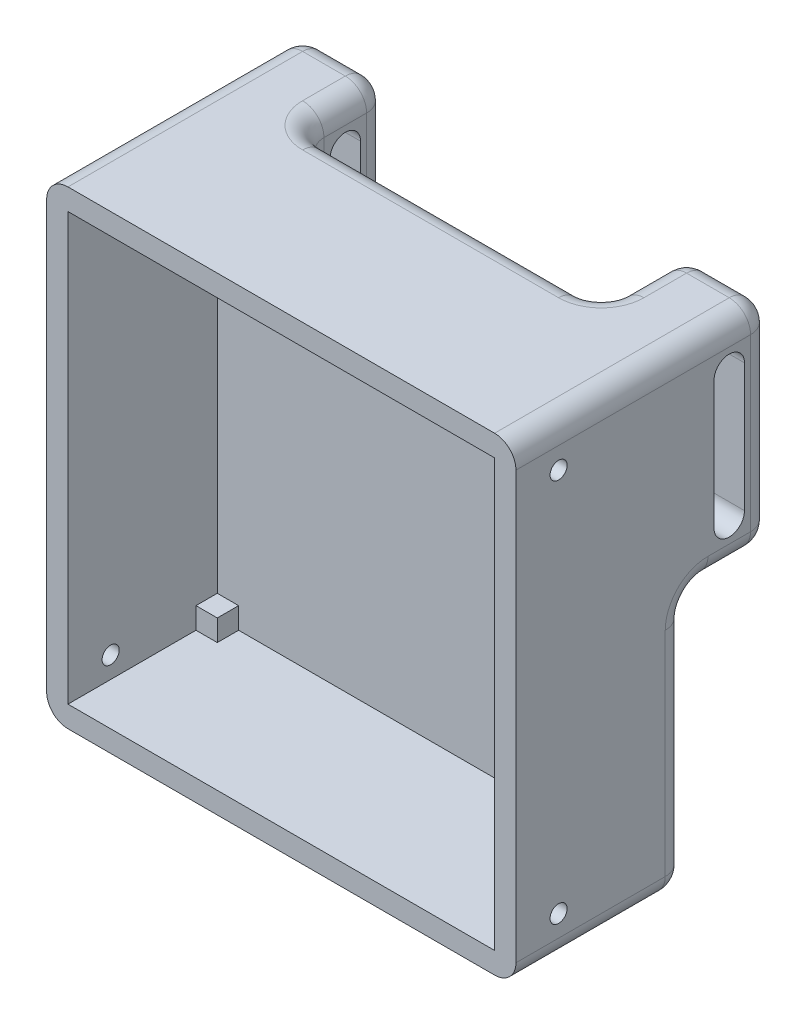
ISO-10303-21;
HEADER;
FILE_DESCRIPTION(('STEP AP214'),'2;1');
FILE_NAME('part.step','',(''),(''),'','','');
FILE_SCHEMA(('AUTOMOTIVE_DESIGN { 1 0 10303 214 1 1 1 1 }'));
ENDSEC;
DATA;
#1=APPLICATION_CONTEXT('core data for automotive mechanical design processes');
#2=APPLICATION_PROTOCOL_DEFINITION('international standard','automotive_design',2000,#1);
#3=PRODUCT_CONTEXT('',#1,'mechanical');
#4=PRODUCT('Part','Part','',(#3));
#5=PRODUCT_RELATED_PRODUCT_CATEGORY('part','',(#4));
#6=PRODUCT_DEFINITION_FORMATION('','',#4);
#7=PRODUCT_DEFINITION_CONTEXT('part definition',#1,'design');
#8=PRODUCT_DEFINITION('design','',#6,#7);
#9=PRODUCT_DEFINITION_SHAPE('','',#8);
#10=(LENGTH_UNIT() NAMED_UNIT(*) SI_UNIT(.MILLI.,.METRE.));
#11=(NAMED_UNIT(*) PLANE_ANGLE_UNIT() SI_UNIT($,.RADIAN.));
#12=(NAMED_UNIT(*) SI_UNIT($,.STERADIAN.) SOLID_ANGLE_UNIT());
#13=UNCERTAINTY_MEASURE_WITH_UNIT(LENGTH_MEASURE(1.E-05),#10,'distance_accuracy_value','');
#14=(GEOMETRIC_REPRESENTATION_CONTEXT(3) GLOBAL_UNCERTAINTY_ASSIGNED_CONTEXT((#13)) GLOBAL_UNIT_ASSIGNED_CONTEXT((#10,
#11,#12)) REPRESENTATION_CONTEXT('',''));
#15=CARTESIAN_POINT('',(0.,0.,0.));
#16=DIRECTION('',(0.,0.,1.));
#17=DIRECTION('',(1.,0.,0.));
#18=AXIS2_PLACEMENT_3D('',#15,#16,#17);
#19=CARTESIAN_POINT('',(0.,0.,5.));
#20=DIRECTION('',(0.,0.,-1.));
#21=DIRECTION('',(-1.,0.,0.));
#22=AXIS2_PLACEMENT_3D('',#19,#20,#21);
#23=PLANE('',#22);
#24=DIRECTION('',(-1.,0.,0.));
#25=VECTOR('',#24,1.);
#26=CARTESIAN_POINT('',(50.,-45.,5.));
#27=LINE('',#26,#25);
#28=CARTESIAN_POINT('',(50.,-45.,5.));
#29=VERTEX_POINT('',#28);
#30=CARTESIAN_POINT('',(45.,-45.,5.));
#31=VERTEX_POINT('',#30);
#32=EDGE_CURVE('E410',#29,#31,#27,.T.);
#33=ORIENTED_EDGE('',*,*,#32,.F.);
#34=DIRECTION('',(0.,1.,0.));
#35=VECTOR('',#34,1.);
#36=CARTESIAN_POINT('',(50.,-50.,5.));
#37=LINE('',#36,#35);
#38=CARTESIAN_POINT('',(50.,45.,5.));
#39=VERTEX_POINT('',#38);
#40=EDGE_CURVE('E624',#29,#39,#37,.T.);
#41=ORIENTED_EDGE('',*,*,#40,.T.);
#42=DIRECTION('',(1.,0.,0.));
#43=VECTOR('',#42,1.);
#44=CARTESIAN_POINT('',(50.,45.,5.));
#45=LINE('',#44,#43);
#46=CARTESIAN_POINT('',(45.,45.,5.));
#47=VERTEX_POINT('',#46);
#48=EDGE_CURVE('E441',#47,#39,#45,.T.);
#49=ORIENTED_EDGE('',*,*,#48,.F.);
#50=DIRECTION('',(0.,-1.,0.));
#51=VECTOR('',#50,1.);
#52=CARTESIAN_POINT('',(45.,50.,5.));
#53=LINE('',#52,#51);
#54=CARTESIAN_POINT('',(45.,50.,5.));
#55=VERTEX_POINT('',#54);
#56=EDGE_CURVE('E445',#55,#47,#53,.T.);
#57=ORIENTED_EDGE('',*,*,#56,.F.);
#58=DIRECTION('',(-1.,0.,0.));
#59=VECTOR('',#58,1.);
#60=CARTESIAN_POINT('',(-50.,50.,5.));
#61=LINE('',#60,#59);
#62=CARTESIAN_POINT('',(-45.,50.,5.));
#63=VERTEX_POINT('',#62);
#64=EDGE_CURVE('E627',#55,#63,#61,.T.);
#65=ORIENTED_EDGE('',*,*,#64,.T.);
#66=DIRECTION('',(0.,1.,0.));
#67=VECTOR('',#66,1.);
#68=CARTESIAN_POINT('',(-45.,50.,5.));
#69=LINE('',#68,#67);
#70=CARTESIAN_POINT('',(-45.,45.,5.));
#71=VERTEX_POINT('',#70);
#72=EDGE_CURVE('E503',#71,#63,#69,.T.);
#73=ORIENTED_EDGE('',*,*,#72,.F.);
#74=DIRECTION('',(1.,0.,0.));
#75=VECTOR('',#74,1.);
#76=CARTESIAN_POINT('',(-50.,45.,5.));
#77=LINE('',#76,#75);
#78=CARTESIAN_POINT('',(-50.,45.,5.));
#79=VERTEX_POINT('',#78);
#80=EDGE_CURVE('E484',#79,#71,#77,.T.);
#81=ORIENTED_EDGE('',*,*,#80,.F.);
#82=DIRECTION('',(0.,-1.,0.));
#83=VECTOR('',#82,1.);
#84=CARTESIAN_POINT('',(-50.,-50.,5.));
#85=LINE('',#84,#83);
#86=CARTESIAN_POINT('',(-50.,-45.,5.));
#87=VERTEX_POINT('',#86);
#88=EDGE_CURVE('E631',#79,#87,#85,.T.);
#89=ORIENTED_EDGE('',*,*,#88,.T.);
#90=DIRECTION('',(-1.,0.,0.));
#91=VECTOR('',#90,1.);
#92=CARTESIAN_POINT('',(-50.,-45.,5.));
#93=LINE('',#92,#91);
#94=CARTESIAN_POINT('',(-45.,-45.,5.));
#95=VERTEX_POINT('',#94);
#96=EDGE_CURVE('E475',#95,#87,#93,.T.);
#97=ORIENTED_EDGE('',*,*,#96,.F.);
#98=DIRECTION('',(0.,1.,0.));
#99=VECTOR('',#98,1.);
#100=CARTESIAN_POINT('',(-45.,-50.,5.));
#101=LINE('',#100,#99);
#102=CARTESIAN_POINT('',(-45.,-50.,5.));
#103=VERTEX_POINT('',#102);
#104=EDGE_CURVE('E479',#103,#95,#101,.T.);
#105=ORIENTED_EDGE('',*,*,#104,.F.);
#106=DIRECTION('',(1.,0.,0.));
#107=VECTOR('',#106,1.);
#108=CARTESIAN_POINT('',(-50.,-50.,5.));
#109=LINE('',#108,#107);
#110=CARTESIAN_POINT('',(45.,-50.,5.));
#111=VERTEX_POINT('',#110);
#112=EDGE_CURVE('E635',#103,#111,#109,.T.);
#113=ORIENTED_EDGE('',*,*,#112,.T.);
#114=DIRECTION('',(0.,-1.,0.));
#115=VECTOR('',#114,1.);
#116=CARTESIAN_POINT('',(45.,-50.,5.));
#117=LINE('',#116,#115);
#118=EDGE_CURVE('E68',#31,#111,#117,.T.);
#119=ORIENTED_EDGE('',*,*,#118,.F.);
#120=EDGE_LOOP('',(#33,#41,#49,#57,#65,#73,#81,#89,#97,#105,#113,#119));
#121=FACE_BOUND('',#120,.T.);
#122=ADVANCED_FACE('F45',(#121),#23,.F.);
#123=CARTESIAN_POINT('',(50.,-50.,5.));
#124=DIRECTION('',(1.,0.,0.));
#125=DIRECTION('',(0.,0.,-1.));
#126=AXIS2_PLACEMENT_3D('',#123,#124,#125);
#127=PLANE('',#126);
#128=CARTESIAN_POINT('',(50.,45.,30.));
#129=DIRECTION('',(1.,0.,0.));
#130=DIRECTION('',(0.,0.,-1.));
#131=AXIS2_PLACEMENT_3D('',#128,#129,#130);
#132=CIRCLE('',#131,2.);
#133=CARTESIAN_POINT('',(50.,45.,28.));
#134=VERTEX_POINT('',#133);
#135=EDGE_CURVE('E553',#134,#134,#132,.T.);
#136=ORIENTED_EDGE('',*,*,#135,.T.);
#137=EDGE_LOOP('',(#136));
#138=FACE_BOUND('',#137,.T.);
#139=CARTESIAN_POINT('',(50.,-45.,30.));
#140=DIRECTION('',(1.,0.,0.));
#141=DIRECTION('',(0.,0.,-1.));
#142=AXIS2_PLACEMENT_3D('',#139,#140,#141);
#143=CIRCLE('',#142,2.);
#144=CARTESIAN_POINT('',(50.,-45.,28.));
#145=VERTEX_POINT('',#144);
#146=EDGE_CURVE('E549',#145,#145,#143,.T.);
#147=ORIENTED_EDGE('',*,*,#146,.T.);
#148=EDGE_LOOP('',(#147));
#149=FACE_BOUND('',#148,.T.);
#150=DIRECTION('',(0.,0.,-1.));
#151=VECTOR('',#150,1.);
#152=CARTESIAN_POINT('',(50.,-45.,10.));
#153=LINE('',#152,#151);
#154=CARTESIAN_POINT('',(50.,-45.,10.));
#155=VERTEX_POINT('',#154);
#156=EDGE_CURVE('E76',#155,#29,#153,.T.);
#157=ORIENTED_EDGE('',*,*,#156,.F.);
#158=DIRECTION('',(0.,1.,0.));
#159=VECTOR('',#158,1.);
#160=CARTESIAN_POINT('',(50.,-50.,10.));
#161=LINE('',#160,#159);
#162=CARTESIAN_POINT('',(50.,-50.,10.));
#163=VERTEX_POINT('',#162);
#164=EDGE_CURVE('E403',#163,#155,#161,.T.);
#165=ORIENTED_EDGE('',*,*,#164,.F.);
#166=DIRECTION('',(0.,0.,1.));
#167=VECTOR('',#166,1.);
#168=CARTESIAN_POINT('',(50.,-50.,5.));
#169=LINE('',#168,#167);
#170=CARTESIAN_POINT('',(50.,-50.,40.));
#171=VERTEX_POINT('',#170);
#172=EDGE_CURVE('E655',#163,#171,#169,.T.);
#173=ORIENTED_EDGE('',*,*,#172,.T.);
#174=DIRECTION('',(0.,1.,0.));
#175=VECTOR('',#174,1.);
#176=CARTESIAN_POINT('',(50.,-50.,40.));
#177=LINE('',#176,#175);
#178=CARTESIAN_POINT('',(50.,50.,40.));
#179=VERTEX_POINT('',#178);
#180=EDGE_CURVE('E639',#171,#179,#177,.T.);
#181=ORIENTED_EDGE('',*,*,#180,.T.);
#182=DIRECTION('',(0.,0.,1.));
#183=VECTOR('',#182,1.);
#184=CARTESIAN_POINT('',(50.,50.,5.));
#185=LINE('',#184,#183);
#186=CARTESIAN_POINT('',(50.,50.,10.));
#187=VERTEX_POINT('',#186);
#188=EDGE_CURVE('E638',#187,#179,#185,.T.);
#189=ORIENTED_EDGE('',*,*,#188,.F.);
#190=DIRECTION('',(0.,1.,0.));
#191=VECTOR('',#190,1.);
#192=CARTESIAN_POINT('',(50.,50.,10.));
#193=LINE('',#192,#191);
#194=CARTESIAN_POINT('',(50.,45.,10.));
#195=VERTEX_POINT('',#194);
#196=EDGE_CURVE('E446',#195,#187,#193,.T.);
#197=ORIENTED_EDGE('',*,*,#196,.F.);
#198=DIRECTION('',(0.,0.,-1.));
#199=VECTOR('',#198,1.);
#200=CARTESIAN_POINT('',(50.,45.,10.));
#201=LINE('',#200,#199);
#202=EDGE_CURVE('E436',#195,#39,#201,.T.);
#203=ORIENTED_EDGE('',*,*,#202,.T.);
#204=ORIENTED_EDGE('',*,*,#40,.F.);
#205=EDGE_LOOP('',(#157,#165,#173,#181,#189,#197,#203,#204));
#206=FACE_BOUND('',#205,.T.);
#207=ADVANCED_FACE('F1214',(#138,#149,#206),#127,.F.);
#208=CARTESIAN_POINT('',(-50.,-50.,5.));
#209=DIRECTION('',(0.,-1.,0.));
#210=DIRECTION('',(0.,0.,-1.));
#211=AXIS2_PLACEMENT_3D('',#208,#209,#210);
#212=PLANE('',#211);
#213=DIRECTION('',(0.,0.,-1.));
#214=VECTOR('',#213,1.);
#215=CARTESIAN_POINT('',(45.,-50.,10.));
#216=LINE('',#215,#214);
#217=CARTESIAN_POINT('',(45.,-50.,10.));
#218=VERTEX_POINT('',#217);
#219=EDGE_CURVE('E413',#218,#111,#216,.T.);
#220=ORIENTED_EDGE('',*,*,#219,.T.);
#221=ORIENTED_EDGE('',*,*,#112,.F.);
#222=DIRECTION('',(0.,0.,-1.));
#223=VECTOR('',#222,1.);
#224=CARTESIAN_POINT('',(-45.,-50.,10.));
#225=LINE('',#224,#223);
#226=CARTESIAN_POINT('',(-45.,-50.,10.));
#227=VERTEX_POINT('',#226);
#228=EDGE_CURVE('E450',#227,#103,#225,.T.);
#229=ORIENTED_EDGE('',*,*,#228,.F.);
#230=DIRECTION('',(1.,0.,0.));
#231=VECTOR('',#230,1.);
#232=CARTESIAN_POINT('',(-50.,-50.,10.));
#233=LINE('',#232,#231);
#234=CARTESIAN_POINT('',(-50.,-50.,10.));
#235=VERTEX_POINT('',#234);
#236=EDGE_CURVE('E491',#235,#227,#233,.T.);
#237=ORIENTED_EDGE('',*,*,#236,.F.);
#238=DIRECTION('',(0.,0.,1.));
#239=VECTOR('',#238,1.);
#240=CARTESIAN_POINT('',(-50.,-50.,5.));
#241=LINE('',#240,#239);
#242=CARTESIAN_POINT('',(-50.,-50.,40.));
#243=VERTEX_POINT('',#242);
#244=EDGE_CURVE('E659',#235,#243,#241,.T.);
#245=ORIENTED_EDGE('',*,*,#244,.T.);
#246=DIRECTION('',(1.,0.,0.));
#247=VECTOR('',#246,1.);
#248=CARTESIAN_POINT('',(-50.,-50.,40.));
#249=LINE('',#248,#247);
#250=EDGE_CURVE('E628',#243,#171,#249,.T.);
#251=ORIENTED_EDGE('',*,*,#250,.T.);
#252=ORIENTED_EDGE('',*,*,#172,.F.);
#253=DIRECTION('',(1.,0.,0.));
#254=VECTOR('',#253,1.);
#255=CARTESIAN_POINT('',(50.,-50.,10.));
#256=LINE('',#255,#254);
#257=EDGE_CURVE('E425',#218,#163,#256,.T.);
#258=ORIENTED_EDGE('',*,*,#257,.F.);
#259=EDGE_LOOP('',(#220,#221,#229,#237,#245,#251,#252,#258));
#260=FACE_BOUND('',#259,.T.);
#261=ADVANCED_FACE('F1219',(#260),#212,.F.);
#262=CARTESIAN_POINT('',(-50.,50.,5.));
#263=DIRECTION('',(0.,1.,0.));
#264=DIRECTION('',(0.,0.,1.));
#265=AXIS2_PLACEMENT_3D('',#262,#263,#264);
#266=PLANE('',#265);
#267=DIRECTION('',(0.,0.,-1.));
#268=VECTOR('',#267,1.);
#269=CARTESIAN_POINT('',(45.,50.,10.));
#270=LINE('',#269,#268);
#271=CARTESIAN_POINT('',(45.,50.,10.));
#272=VERTEX_POINT('',#271);
#273=EDGE_CURVE('E428',#272,#55,#270,.T.);
#274=ORIENTED_EDGE('',*,*,#273,.F.);
#275=DIRECTION('',(-1.,0.,0.));
#276=VECTOR('',#275,1.);
#277=CARTESIAN_POINT('',(50.,50.,10.));
#278=LINE('',#277,#276);
#279=EDGE_CURVE('E457',#187,#272,#278,.T.);
#280=ORIENTED_EDGE('',*,*,#279,.F.);
#281=ORIENTED_EDGE('',*,*,#188,.T.);
#282=DIRECTION('',(-1.,0.,0.));
#283=VECTOR('',#282,1.);
#284=CARTESIAN_POINT('',(-50.,50.,40.));
#285=LINE('',#284,#283);
#286=CARTESIAN_POINT('',(-50.,50.,40.));
#287=VERTEX_POINT('',#286);
#288=EDGE_CURVE('E643',#179,#287,#285,.T.);
#289=ORIENTED_EDGE('',*,*,#288,.T.);
#290=DIRECTION('',(0.,0.,1.));
#291=VECTOR('',#290,1.);
#292=CARTESIAN_POINT('',(-50.,50.,5.));
#293=LINE('',#292,#291);
#294=CARTESIAN_POINT('',(-50.,50.,10.));
#295=VERTEX_POINT('',#294);
#296=EDGE_CURVE('E662',#295,#287,#293,.T.);
#297=ORIENTED_EDGE('',*,*,#296,.F.);
#298=DIRECTION('',(-1.,0.,0.));
#299=VECTOR('',#298,1.);
#300=CARTESIAN_POINT('',(-50.,50.,10.));
#301=LINE('',#300,#299);
#302=CARTESIAN_POINT('',(-45.,50.,10.));
#303=VERTEX_POINT('',#302);
#304=EDGE_CURVE('E510',#303,#295,#301,.T.);
#305=ORIENTED_EDGE('',*,*,#304,.F.);
#306=DIRECTION('',(0.,0.,-1.));
#307=VECTOR('',#306,1.);
#308=CARTESIAN_POINT('',(-45.,50.,10.));
#309=LINE('',#308,#307);
#310=EDGE_CURVE('E514',#303,#63,#309,.T.);
#311=ORIENTED_EDGE('',*,*,#310,.T.);
#312=ORIENTED_EDGE('',*,*,#64,.F.);
#313=EDGE_LOOP('',(#274,#280,#281,#289,#297,#305,#311,#312));
#314=FACE_BOUND('',#313,.T.);
#315=ADVANCED_FACE('F1228',(#314),#266,.F.);
#316=CARTESIAN_POINT('',(-50.,-50.,5.));
#317=DIRECTION('',(-1.,0.,0.));
#318=DIRECTION('',(0.,0.,1.));
#319=AXIS2_PLACEMENT_3D('',#316,#317,#318);
#320=PLANE('',#319);
#321=CARTESIAN_POINT('',(-50.,45.,30.));
#322=DIRECTION('',(-1.,0.,0.));
#323=DIRECTION('',(0.,0.,1.));
#324=AXIS2_PLACEMENT_3D('',#321,#322,#323);
#325=CIRCLE('',#324,2.);
#326=CARTESIAN_POINT('',(-50.,45.,32.));
#327=VERTEX_POINT('',#326);
#328=EDGE_CURVE('E54',#327,#327,#325,.T.);
#329=ORIENTED_EDGE('',*,*,#328,.T.);
#330=EDGE_LOOP('',(#329));
#331=FACE_BOUND('',#330,.T.);
#332=CARTESIAN_POINT('',(-50.,-45.,30.));
#333=DIRECTION('',(-1.,0.,0.));
#334=DIRECTION('',(0.,0.,1.));
#335=AXIS2_PLACEMENT_3D('',#332,#333,#334);
#336=CIRCLE('',#335,2.);
#337=CARTESIAN_POINT('',(-50.,-45.,32.));
#338=VERTEX_POINT('',#337);
#339=EDGE_CURVE('E537',#338,#338,#336,.T.);
#340=ORIENTED_EDGE('',*,*,#339,.T.);
#341=EDGE_LOOP('',(#340));
#342=FACE_BOUND('',#341,.T.);
#343=DIRECTION('',(0.,0.,-1.));
#344=VECTOR('',#343,1.);
#345=CARTESIAN_POINT('',(-50.,-45.,10.));
#346=LINE('',#345,#344);
#347=CARTESIAN_POINT('',(-50.,-45.,10.));
#348=VERTEX_POINT('',#347);
#349=EDGE_CURVE('E471',#348,#87,#346,.T.);
#350=ORIENTED_EDGE('',*,*,#349,.T.);
#351=ORIENTED_EDGE('',*,*,#88,.F.);
#352=DIRECTION('',(0.,0.,-1.));
#353=VECTOR('',#352,1.);
#354=CARTESIAN_POINT('',(-50.,45.,10.));
#355=LINE('',#354,#353);
#356=CARTESIAN_POINT('',(-50.,45.,10.));
#357=VERTEX_POINT('',#356);
#358=EDGE_CURVE('E528',#357,#79,#355,.T.);
#359=ORIENTED_EDGE('',*,*,#358,.F.);
#360=DIRECTION('',(0.,-1.,0.));
#361=VECTOR('',#360,1.);
#362=CARTESIAN_POINT('',(-50.,50.,10.));
#363=LINE('',#362,#361);
#364=EDGE_CURVE('E498',#295,#357,#363,.T.);
#365=ORIENTED_EDGE('',*,*,#364,.F.);
#366=ORIENTED_EDGE('',*,*,#296,.T.);
#367=DIRECTION('',(0.,-1.,0.));
#368=VECTOR('',#367,1.);
#369=CARTESIAN_POINT('',(-50.,-50.,40.));
#370=LINE('',#369,#368);
#371=EDGE_CURVE('E648',#287,#243,#370,.T.);
#372=ORIENTED_EDGE('',*,*,#371,.T.);
#373=ORIENTED_EDGE('',*,*,#244,.F.);
#374=DIRECTION('',(0.,-1.,0.));
#375=VECTOR('',#374,1.);
#376=CARTESIAN_POINT('',(-50.,-50.,10.));
#377=LINE('',#376,#375);
#378=EDGE_CURVE('E480',#348,#235,#377,.T.);
#379=ORIENTED_EDGE('',*,*,#378,.F.);
#380=EDGE_LOOP('',(#350,#351,#359,#365,#366,#372,#373,#379));
#381=FACE_BOUND('',#380,.T.);
#382=ADVANCED_FACE('F1230',(#331,#342,#381),#320,.F.);
#383=CARTESIAN_POINT('',(0.,0.,0.));
#384=DIRECTION('',(0.,0.,-1.));
#385=DIRECTION('',(-1.,0.,0.));
#386=AXIS2_PLACEMENT_3D('',#383,#384,#385);
#387=PLANE('',#386);
#388=DIRECTION('',(1.,0.,0.));
#389=VECTOR('',#388,1.);
#390=CARTESIAN_POINT('',(-55.,-50.,0.));
#391=LINE('',#390,#389);
#392=CARTESIAN_POINT('',(50.,-50.,0.));
#393=VERTEX_POINT('',#392);
#394=CARTESIAN_POINT('',(-50.,-50.,0.));
#395=VERTEX_POINT('',#394);
#396=EDGE_CURVE('E812',#393,#395,#391,.F.);
#397=ORIENTED_EDGE('',*,*,#396,.T.);
#398=DIRECTION('',(0.,-1.,0.));
#399=VECTOR('',#398,1.);
#400=CARTESIAN_POINT('',(-50.,5.,0.));
#401=LINE('',#400,#399);
#402=CARTESIAN_POINT('',(-50.,0.,0.));
#403=VERTEX_POINT('',#402);
#404=EDGE_CURVE('E815',#395,#403,#401,.F.);
#405=ORIENTED_EDGE('',*,*,#404,.T.);
#406=DIRECTION('',(-1.,0.,0.));
#407=VECTOR('',#406,1.);
#408=CARTESIAN_POINT('',(0.,0.,0.));
#409=LINE('',#408,#407);
#410=CARTESIAN_POINT('',(-30.,0.,0.));
#411=VERTEX_POINT('',#410);
#412=EDGE_CURVE('E792',#403,#411,#409,.F.);
#413=ORIENTED_EDGE('',*,*,#412,.T.);
#414=DIRECTION('',(0.,-1.,0.));
#415=VECTOR('',#414,1.);
#416=CARTESIAN_POINT('',(-30.,0.,0.));
#417=LINE('',#416,#415);
#418=CARTESIAN_POINT('',(-30.,50.,0.));
#419=VERTEX_POINT('',#418);
#420=EDGE_CURVE('E796',#411,#419,#417,.F.);
#421=ORIENTED_EDGE('',*,*,#420,.T.);
#422=DIRECTION('',(-1.,0.,0.));
#423=VECTOR('',#422,1.);
#424=CARTESIAN_POINT('',(35.,50.,0.));
#425=LINE('',#424,#423);
#426=CARTESIAN_POINT('',(30.,50.,0.));
#427=VERTEX_POINT('',#426);
#428=EDGE_CURVE('E799',#419,#427,#425,.F.);
#429=ORIENTED_EDGE('',*,*,#428,.T.);
#430=DIRECTION('',(0.,1.,0.));
#431=VECTOR('',#430,1.);
#432=CARTESIAN_POINT('',(30.,0.,0.));
#433=LINE('',#432,#431);
#434=CARTESIAN_POINT('',(30.,0.,0.));
#435=VERTEX_POINT('',#434);
#436=EDGE_CURVE('E802',#427,#435,#433,.F.);
#437=ORIENTED_EDGE('',*,*,#436,.T.);
#438=DIRECTION('',(-1.,0.,0.));
#439=VECTOR('',#438,1.);
#440=CARTESIAN_POINT('',(0.,0.,0.));
#441=LINE('',#440,#439);
#442=CARTESIAN_POINT('',(50.,0.,0.));
#443=VERTEX_POINT('',#442);
#444=EDGE_CURVE('E806',#435,#443,#441,.F.);
#445=ORIENTED_EDGE('',*,*,#444,.T.);
#446=DIRECTION('',(0.,1.,0.));
#447=VECTOR('',#446,1.);
#448=CARTESIAN_POINT('',(50.,-55.,0.));
#449=LINE('',#448,#447);
#450=EDGE_CURVE('E809',#443,#393,#449,.F.);
#451=ORIENTED_EDGE('',*,*,#450,.T.);
#452=EDGE_LOOP('',(#397,#405,#413,#421,#429,#437,#445,#451));
#453=FACE_BOUND('',#452,.T.);
#454=ADVANCED_FACE('F1233',(#453),#387,.T.);
#455=CARTESIAN_POINT('',(55.,-55.,40.));
#456=DIRECTION('',(-1.,0.,0.));
#457=DIRECTION('',(0.,0.,1.));
#458=AXIS2_PLACEMENT_3D('',#455,#456,#457);
#459=PLANE('',#458);
#460=CARTESIAN_POINT('',(55.,45.,30.));
#461=DIRECTION('',(-1.,0.,0.));
#462=DIRECTION('',(0.,0.,1.));
#463=AXIS2_PLACEMENT_3D('',#460,#461,#462);
#464=CIRCLE('',#463,2.);
#465=CARTESIAN_POINT('',(55.,45.,32.));
#466=VERTEX_POINT('',#465);
#467=EDGE_CURVE('E533',#466,#466,#464,.T.);
#468=ORIENTED_EDGE('',*,*,#467,.T.);
#469=EDGE_LOOP('',(#468));
#470=FACE_BOUND('',#469,.T.);
#471=CARTESIAN_POINT('',(55.,-45.,30.));
#472=DIRECTION('',(-1.,0.,0.));
#473=DIRECTION('',(0.,0.,1.));
#474=AXIS2_PLACEMENT_3D('',#471,#472,#473);
#475=CIRCLE('',#474,2.);
#476=CARTESIAN_POINT('',(55.,-45.,32.));
#477=VERTEX_POINT('',#476);
#478=EDGE_CURVE('E532',#477,#477,#475,.T.);
#479=ORIENTED_EDGE('',*,*,#478,.T.);
#480=EDGE_LOOP('',(#479));
#481=FACE_BOUND('',#480,.T.);
#482=DIRECTION('',(0.,1.,0.));
#483=VECTOR('',#482,1.);
#484=CARTESIAN_POINT('',(55.,-55.,-6.42673425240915));
#485=LINE('',#484,#483);
#486=CARTESIAN_POINT('',(55.,15.,-6.42673425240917));
#487=VERTEX_POINT('',#486);
#488=CARTESIAN_POINT('',(55.,45.,-6.42673425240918));
#489=VERTEX_POINT('',#488);
#490=EDGE_CURVE('E611',#487,#489,#485,.T.);
#491=ORIENTED_EDGE('',*,*,#490,.T.);
#492=CARTESIAN_POINT('',(55.,45.,-10.));
#493=DIRECTION('',(-1.,0.,0.));
#494=DIRECTION('',(0.,0.,1.));
#495=AXIS2_PLACEMENT_3D('',#492,#493,#494);
#496=CIRCLE('',#495,3.57326574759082);
#497=CARTESIAN_POINT('',(55.,45.,-13.5732657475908));
#498=VERTEX_POINT('',#497);
#499=EDGE_CURVE('E619',#489,#498,#496,.T.);
#500=ORIENTED_EDGE('',*,*,#499,.T.);
#501=DIRECTION('',(0.,-1.,0.));
#502=VECTOR('',#501,1.);
#503=CARTESIAN_POINT('',(55.,-55.,-13.5732657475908));
#504=LINE('',#503,#502);
#505=CARTESIAN_POINT('',(55.,15.,-13.5732657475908));
#506=VERTEX_POINT('',#505);
#507=EDGE_CURVE('E595',#498,#506,#504,.T.);
#508=ORIENTED_EDGE('',*,*,#507,.T.);
#509=CARTESIAN_POINT('',(55.,15.,-10.));
#510=DIRECTION('',(-1.,0.,0.));
#511=DIRECTION('',(0.,0.,1.));
#512=AXIS2_PLACEMENT_3D('',#509,#510,#511);
#513=CIRCLE('',#512,3.57326574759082);
#514=EDGE_CURVE('E603',#506,#487,#513,.T.);
#515=ORIENTED_EDGE('',*,*,#514,.T.);
#516=EDGE_LOOP('',(#491,#500,#508,#515));
#517=FACE_BOUND('',#516,.T.);
#518=DIRECTION('',(0.,1.,0.));
#519=VECTOR('',#518,1.);
#520=CARTESIAN_POINT('',(55.,-55.,40.));
#521=LINE('',#520,#519);
#522=CARTESIAN_POINT('',(55.,-50.,40.));
#523=VERTEX_POINT('',#522);
#524=CARTESIAN_POINT('',(55.,50.,40.));
#525=VERTEX_POINT('',#524);
#526=EDGE_CURVE('E658',#523,#525,#521,.T.);
#527=ORIENTED_EDGE('',*,*,#526,.F.);
#528=DIRECTION('',(0.,0.,-1.));
#529=VECTOR('',#528,1.);
#530=CARTESIAN_POINT('',(55.,-50.,40.));
#531=LINE('',#530,#529);
#532=CARTESIAN_POINT('',(55.,-50.,5.));
#533=VERTEX_POINT('',#532);
#534=EDGE_CURVE('E740',#523,#533,#531,.T.);
#535=ORIENTED_EDGE('',*,*,#534,.T.);
#536=DIRECTION('',(0.,1.,0.));
#537=VECTOR('',#536,1.);
#538=CARTESIAN_POINT('',(55.,5.,5.));
#539=LINE('',#538,#537);
#540=CARTESIAN_POINT('',(55.,0.,5.));
#541=VERTEX_POINT('',#540);
#542=EDGE_CURVE('E737',#533,#541,#539,.T.);
#543=ORIENTED_EDGE('',*,*,#542,.T.);
#544=CARTESIAN_POINT('',(55.,0.,-5.));
#545=DIRECTION('',(-1.,0.,0.));
#546=DIRECTION('',(0.,0.,1.));
#547=AXIS2_PLACEMENT_3D('',#544,#545,#546);
#548=CIRCLE('',#547,10.);
#549=CARTESIAN_POINT('',(55.,10.,-5.));
#550=VERTEX_POINT('',#549);
#551=EDGE_CURVE('E733',#550,#541,#548,.F.);
#552=ORIENTED_EDGE('',*,*,#551,.F.);
#553=DIRECTION('',(0.,0.,1.));
#554=VECTOR('',#553,1.);
#555=CARTESIAN_POINT('',(55.,10.,40.));
#556=LINE('',#555,#554);
#557=CARTESIAN_POINT('',(55.,10.,-15.));
#558=VERTEX_POINT('',#557);
#559=EDGE_CURVE('E730',#550,#558,#556,.F.);
#560=ORIENTED_EDGE('',*,*,#559,.T.);
#561=DIRECTION('',(0.,-1.,0.));
#562=VECTOR('',#561,1.);
#563=CARTESIAN_POINT('',(55.,55.,-15.));
#564=LINE('',#563,#562);
#565=CARTESIAN_POINT('',(55.,50.,-15.));
#566=VERTEX_POINT('',#565);
#567=EDGE_CURVE('E724',#558,#566,#564,.F.);
#568=ORIENTED_EDGE('',*,*,#567,.T.);
#569=DIRECTION('',(0.,0.,-1.));
#570=VECTOR('',#569,1.);
#571=CARTESIAN_POINT('',(55.,50.,40.));
#572=LINE('',#571,#570);
#573=EDGE_CURVE('E727',#566,#525,#572,.F.);
#574=ORIENTED_EDGE('',*,*,#573,.T.);
#575=EDGE_LOOP('',(#527,#535,#543,#552,#560,#568,#574));
#576=FACE_BOUND('',#575,.T.);
#577=ADVANCED_FACE('F1245',(#470,#481,#517,#576),#459,.F.);
#578=CARTESIAN_POINT('',(-55.,55.,40.));
#579=DIRECTION('',(0.,-1.,0.));
#580=DIRECTION('',(0.,0.,-1.));
#581=AXIS2_PLACEMENT_3D('',#578,#579,#580);
#582=PLANE('',#581);
#583=DIRECTION('',(1.,0.,0.));
#584=VECTOR('',#583,1.);
#585=CARTESIAN_POINT('',(-55.,55.,-15.));
#586=LINE('',#585,#584);
#587=CARTESIAN_POINT('',(-40.,55.,-15.));
#588=VERTEX_POINT('',#587);
#589=CARTESIAN_POINT('',(-50.,55.,-15.));
#590=VERTEX_POINT('',#589);
#591=EDGE_CURVE('E766',#588,#590,#586,.F.);
#592=ORIENTED_EDGE('',*,*,#591,.T.);
#593=DIRECTION('',(0.,0.,-1.));
#594=VECTOR('',#593,1.);
#595=CARTESIAN_POINT('',(-50.,55.,40.));
#596=LINE('',#595,#594);
#597=CARTESIAN_POINT('',(-50.,55.,40.));
#598=VERTEX_POINT('',#597);
#599=EDGE_CURVE('E769',#590,#598,#596,.F.);
#600=ORIENTED_EDGE('',*,*,#599,.T.);
#601=DIRECTION('',(-1.,0.,0.));
#602=VECTOR('',#601,1.);
#603=CARTESIAN_POINT('',(-55.,55.,40.));
#604=LINE('',#603,#602);
#605=CARTESIAN_POINT('',(50.,55.,40.));
#606=VERTEX_POINT('',#605);
#607=EDGE_CURVE('E670',#606,#598,#604,.T.);
#608=ORIENTED_EDGE('',*,*,#607,.F.);
#609=DIRECTION('',(0.,0.,-1.));
#610=VECTOR('',#609,1.);
#611=CARTESIAN_POINT('',(50.,55.,40.));
#612=LINE('',#611,#610);
#613=CARTESIAN_POINT('',(50.,55.,-15.));
#614=VERTEX_POINT('',#613);
#615=EDGE_CURVE('E746',#606,#614,#612,.T.);
#616=ORIENTED_EDGE('',*,*,#615,.T.);
#617=DIRECTION('',(1.,0.,0.));
#618=VECTOR('',#617,1.);
#619=CARTESIAN_POINT('',(35.,55.,-15.));
#620=LINE('',#619,#618);
#621=CARTESIAN_POINT('',(40.,55.,-15.));
#622=VERTEX_POINT('',#621);
#623=EDGE_CURVE('E743',#614,#622,#620,.F.);
#624=ORIENTED_EDGE('',*,*,#623,.T.);
#625=DIRECTION('',(0.,0.,1.));
#626=VECTOR('',#625,1.);
#627=CARTESIAN_POINT('',(40.,55.,40.));
#628=LINE('',#627,#626);
#629=CARTESIAN_POINT('',(40.,55.,-5.));
#630=VERTEX_POINT('',#629);
#631=EDGE_CURVE('E749',#622,#630,#628,.T.);
#632=ORIENTED_EDGE('',*,*,#631,.T.);
#633=CARTESIAN_POINT('',(30.,55.,-5.));
#634=DIRECTION('',(0.,-1.,0.));
#635=DIRECTION('',(0.,0.,-1.));
#636=AXIS2_PLACEMENT_3D('',#633,#634,#635);
#637=CIRCLE('',#636,10.);
#638=CARTESIAN_POINT('',(30.,55.,5.));
#639=VERTEX_POINT('',#638);
#640=EDGE_CURVE('E752',#639,#630,#637,.F.);
#641=ORIENTED_EDGE('',*,*,#640,.F.);
#642=DIRECTION('',(-1.,0.,0.));
#643=VECTOR('',#642,1.);
#644=CARTESIAN_POINT('',(-35.,55.,5.));
#645=LINE('',#644,#643);
#646=CARTESIAN_POINT('',(-30.,55.,5.));
#647=VERTEX_POINT('',#646);
#648=EDGE_CURVE('E756',#639,#647,#645,.T.);
#649=ORIENTED_EDGE('',*,*,#648,.T.);
#650=CARTESIAN_POINT('',(-30.,55.,-5.));
#651=DIRECTION('',(0.,-1.,0.));
#652=DIRECTION('',(0.,0.,-1.));
#653=AXIS2_PLACEMENT_3D('',#650,#651,#652);
#654=CIRCLE('',#653,10.);
#655=CARTESIAN_POINT('',(-40.,55.,-5.));
#656=VERTEX_POINT('',#655);
#657=EDGE_CURVE('E759',#656,#647,#654,.F.);
#658=ORIENTED_EDGE('',*,*,#657,.F.);
#659=DIRECTION('',(0.,0.,1.));
#660=VECTOR('',#659,1.);
#661=CARTESIAN_POINT('',(-40.,55.,40.));
#662=LINE('',#661,#660);
#663=EDGE_CURVE('E763',#656,#588,#662,.F.);
#664=ORIENTED_EDGE('',*,*,#663,.T.);
#665=EDGE_LOOP('',(#592,#600,#608,#616,#624,#632,#641,#649,#658,#664));
#666=FACE_BOUND('',#665,.T.);
#667=ADVANCED_FACE('F1253',(#666),#582,.F.);
#668=CARTESIAN_POINT('',(-55.,-55.,40.));
#669=DIRECTION('',(1.,0.,0.));
#670=DIRECTION('',(0.,0.,-1.));
#671=AXIS2_PLACEMENT_3D('',#668,#669,#670);
#672=PLANE('',#671);
#673=CARTESIAN_POINT('',(-55.,45.,30.));
#674=DIRECTION('',(-1.,0.,0.));
#675=DIRECTION('',(0.,0.,1.));
#676=AXIS2_PLACEMENT_3D('',#673,#674,#675);
#677=CIRCLE('',#676,2.);
#678=CARTESIAN_POINT('',(-55.,45.,32.));
#679=VERTEX_POINT('',#678);
#680=EDGE_CURVE('E538',#679,#679,#677,.T.);
#681=ORIENTED_EDGE('',*,*,#680,.F.);
#682=EDGE_LOOP('',(#681));
#683=FACE_BOUND('',#682,.T.);
#684=CARTESIAN_POINT('',(-55.,-45.,30.));
#685=DIRECTION('',(-1.,0.,0.));
#686=DIRECTION('',(0.,0.,1.));
#687=AXIS2_PLACEMENT_3D('',#684,#685,#686);
#688=CIRCLE('',#687,2.);
#689=CARTESIAN_POINT('',(-55.,-45.,32.));
#690=VERTEX_POINT('',#689);
#691=EDGE_CURVE('E542',#690,#690,#688,.T.);
#692=ORIENTED_EDGE('',*,*,#691,.F.);
#693=EDGE_LOOP('',(#692));
#694=FACE_BOUND('',#693,.T.);
#695=DIRECTION('',(0.,-1.,0.));
#696=VECTOR('',#695,1.);
#697=CARTESIAN_POINT('',(-55.,45.,-13.5732657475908));
#698=LINE('',#697,#696);
#699=CARTESIAN_POINT('',(-55.,45.,-13.5732657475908));
#700=VERTEX_POINT('',#699);
#701=CARTESIAN_POINT('',(-55.,15.,-13.5732657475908));
#702=VERTEX_POINT('',#701);
#703=EDGE_CURVE('E561',#700,#702,#698,.T.);
#704=ORIENTED_EDGE('',*,*,#703,.F.);
#705=CARTESIAN_POINT('',(-55.,45.,-10.));
#706=DIRECTION('',(-1.,0.,0.));
#707=DIRECTION('',(0.,0.,1.));
#708=AXIS2_PLACEMENT_3D('',#705,#706,#707);
#709=CIRCLE('',#708,3.57326574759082);
#710=CARTESIAN_POINT('',(-55.,45.,-6.42673425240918));
#711=VERTEX_POINT('',#710);
#712=EDGE_CURVE('E558',#711,#700,#709,.T.);
#713=ORIENTED_EDGE('',*,*,#712,.F.);
#714=DIRECTION('',(0.,1.,0.));
#715=VECTOR('',#714,1.);
#716=CARTESIAN_POINT('',(-55.,45.,-6.42673425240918));
#717=LINE('',#716,#715);
#718=CARTESIAN_POINT('',(-55.,15.,-6.42673425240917));
#719=VERTEX_POINT('',#718);
#720=EDGE_CURVE('E570',#719,#711,#717,.T.);
#721=ORIENTED_EDGE('',*,*,#720,.F.);
#722=CARTESIAN_POINT('',(-55.,15.,-10.));
#723=DIRECTION('',(-1.,0.,0.));
#724=DIRECTION('',(0.,0.,1.));
#725=AXIS2_PLACEMENT_3D('',#722,#723,#724);
#726=CIRCLE('',#725,3.57326574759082);
#727=EDGE_CURVE('E566',#702,#719,#726,.T.);
#728=ORIENTED_EDGE('',*,*,#727,.F.);
#729=EDGE_LOOP('',(#704,#713,#721,#728));
#730=FACE_BOUND('',#729,.T.);
#731=DIRECTION('',(0.,-1.,0.));
#732=VECTOR('',#731,1.);
#733=CARTESIAN_POINT('',(-55.,-55.,5.));
#734=LINE('',#733,#732);
#735=CARTESIAN_POINT('',(-55.,0.,5.));
#736=VERTEX_POINT('',#735);
#737=CARTESIAN_POINT('',(-55.,-50.,5.));
#738=VERTEX_POINT('',#737);
#739=EDGE_CURVE('E696',#736,#738,#734,.T.);
#740=ORIENTED_EDGE('',*,*,#739,.T.);
#741=DIRECTION('',(0.,0.,-1.));
#742=VECTOR('',#741,1.);
#743=CARTESIAN_POINT('',(-55.,-50.,40.));
#744=LINE('',#743,#742);
#745=CARTESIAN_POINT('',(-55.,-50.,40.));
#746=VERTEX_POINT('',#745);
#747=EDGE_CURVE('E699',#738,#746,#744,.F.);
#748=ORIENTED_EDGE('',*,*,#747,.T.);
#749=DIRECTION('',(0.,-1.,0.));
#750=VECTOR('',#749,1.);
#751=CARTESIAN_POINT('',(-55.,-55.,40.));
#752=LINE('',#751,#750);
#753=CARTESIAN_POINT('',(-55.,50.,40.));
#754=VERTEX_POINT('',#753);
#755=EDGE_CURVE('E674',#754,#746,#752,.T.);
#756=ORIENTED_EDGE('',*,*,#755,.F.);
#757=DIRECTION('',(0.,0.,-1.));
#758=VECTOR('',#757,1.);
#759=CARTESIAN_POINT('',(-55.,50.,40.));
#760=LINE('',#759,#758);
#761=CARTESIAN_POINT('',(-55.,50.,-15.));
#762=VERTEX_POINT('',#761);
#763=EDGE_CURVE('E685',#754,#762,#760,.T.);
#764=ORIENTED_EDGE('',*,*,#763,.T.);
#765=DIRECTION('',(0.,1.,0.));
#766=VECTOR('',#765,1.);
#767=CARTESIAN_POINT('',(-55.,-55.,-15.));
#768=LINE('',#767,#766);
#769=CARTESIAN_POINT('',(-55.,10.,-15.));
#770=VERTEX_POINT('',#769);
#771=EDGE_CURVE('E682',#762,#770,#768,.F.);
#772=ORIENTED_EDGE('',*,*,#771,.T.);
#773=DIRECTION('',(0.,0.,1.));
#774=VECTOR('',#773,1.);
#775=CARTESIAN_POINT('',(-55.,10.,40.));
#776=LINE('',#775,#774);
#777=CARTESIAN_POINT('',(-55.,10.,-5.));
#778=VERTEX_POINT('',#777);
#779=EDGE_CURVE('E688',#770,#778,#776,.T.);
#780=ORIENTED_EDGE('',*,*,#779,.T.);
#781=CARTESIAN_POINT('',(-55.,0.,-5.));
#782=DIRECTION('',(1.,0.,0.));
#783=DIRECTION('',(0.,0.,-1.));
#784=AXIS2_PLACEMENT_3D('',#781,#782,#783);
#785=CIRCLE('',#784,10.);
#786=EDGE_CURVE('E692',#736,#778,#785,.F.);
#787=ORIENTED_EDGE('',*,*,#786,.F.);
#788=EDGE_LOOP('',(#740,#748,#756,#764,#772,#780,#787));
#789=FACE_BOUND('',#788,.T.);
#790=ADVANCED_FACE('F1249',(#683,#694,#730,#789),#672,.F.);
#791=CARTESIAN_POINT('',(-55.,-55.,40.));
#792=DIRECTION('',(0.,1.,0.));
#793=DIRECTION('',(0.,0.,1.));
#794=AXIS2_PLACEMENT_3D('',#791,#792,#793);
#795=PLANE('',#794);
#796=DIRECTION('',(1.,0.,0.));
#797=VECTOR('',#796,1.);
#798=CARTESIAN_POINT('',(-55.,-55.,40.));
#799=LINE('',#798,#797);
#800=CARTESIAN_POINT('',(-50.,-55.,40.));
#801=VERTEX_POINT('',#800);
#802=CARTESIAN_POINT('',(50.,-55.,40.));
#803=VERTEX_POINT('',#802);
#804=EDGE_CURVE('E678',#801,#803,#799,.T.);
#805=ORIENTED_EDGE('',*,*,#804,.F.);
#806=DIRECTION('',(0.,0.,-1.));
#807=VECTOR('',#806,1.);
#808=CARTESIAN_POINT('',(-50.,-55.,40.));
#809=LINE('',#808,#807);
#810=CARTESIAN_POINT('',(-50.,-55.,5.));
#811=VERTEX_POINT('',#810);
#812=EDGE_CURVE('E825',#801,#811,#809,.T.);
#813=ORIENTED_EDGE('',*,*,#812,.T.);
#814=DIRECTION('',(1.,0.,0.));
#815=VECTOR('',#814,1.);
#816=CARTESIAN_POINT('',(55.,-55.,5.));
#817=LINE('',#816,#815);
#818=CARTESIAN_POINT('',(50.,-55.,5.));
#819=VERTEX_POINT('',#818);
#820=EDGE_CURVE('E822',#811,#819,#817,.T.);
#821=ORIENTED_EDGE('',*,*,#820,.T.);
#822=DIRECTION('',(0.,0.,-1.));
#823=VECTOR('',#822,1.);
#824=CARTESIAN_POINT('',(50.,-55.,40.));
#825=LINE('',#824,#823);
#826=EDGE_CURVE('E819',#819,#803,#825,.F.);
#827=ORIENTED_EDGE('',*,*,#826,.T.);
#828=EDGE_LOOP('',(#805,#813,#821,#827));
#829=FACE_BOUND('',#828,.T.);
#830=ADVANCED_FACE('F1241',(#829),#795,.F.);
#831=CARTESIAN_POINT('',(0.,0.,40.));
#832=DIRECTION('',(0.,0.,-1.));
#833=DIRECTION('',(-1.,0.,0.));
#834=AXIS2_PLACEMENT_3D('',#831,#832,#833);
#835=PLANE('',#834);
#836=ORIENTED_EDGE('',*,*,#288,.F.);
#837=ORIENTED_EDGE('',*,*,#180,.F.);
#838=ORIENTED_EDGE('',*,*,#250,.F.);
#839=ORIENTED_EDGE('',*,*,#371,.F.);
#840=EDGE_LOOP('',(#836,#837,#838,#839));
#841=FACE_BOUND('',#840,.T.);
#842=ORIENTED_EDGE('',*,*,#755,.T.);
#843=CARTESIAN_POINT('',(-50.,-50.,40.));
#844=DIRECTION('',(0.,0.,-1.));
#845=DIRECTION('',(-1.,0.,0.));
#846=AXIS2_PLACEMENT_3D('',#843,#844,#845);
#847=CIRCLE('',#846,5.);
#848=EDGE_CURVE('E837',#746,#801,#847,.F.);
#849=ORIENTED_EDGE('',*,*,#848,.T.);
#850=ORIENTED_EDGE('',*,*,#804,.T.);
#851=CARTESIAN_POINT('',(50.,-50.,40.));
#852=DIRECTION('',(0.,0.,-1.));
#853=DIRECTION('',(-1.,0.,0.));
#854=AXIS2_PLACEMENT_3D('',#851,#852,#853);
#855=CIRCLE('',#854,5.);
#856=EDGE_CURVE('E834',#803,#523,#855,.F.);
#857=ORIENTED_EDGE('',*,*,#856,.T.);
#858=ORIENTED_EDGE('',*,*,#526,.T.);
#859=CARTESIAN_POINT('',(50.,50.,40.));
#860=DIRECTION('',(0.,0.,-1.));
#861=DIRECTION('',(-1.,0.,0.));
#862=AXIS2_PLACEMENT_3D('',#859,#860,#861);
#863=CIRCLE('',#862,5.);
#864=EDGE_CURVE('E831',#525,#606,#863,.F.);
#865=ORIENTED_EDGE('',*,*,#864,.T.);
#866=ORIENTED_EDGE('',*,*,#607,.T.);
#867=CARTESIAN_POINT('',(-50.,50.,40.));
#868=DIRECTION('',(0.,0.,-1.));
#869=DIRECTION('',(-1.,0.,0.));
#870=AXIS2_PLACEMENT_3D('',#867,#868,#869);
#871=CIRCLE('',#870,5.);
#872=EDGE_CURVE('E828',#598,#754,#871,.F.);
#873=ORIENTED_EDGE('',*,*,#872,.T.);
#874=EDGE_LOOP('',(#842,#849,#850,#857,#858,#865,#866,#873));
#875=FACE_BOUND('',#874,.T.);
#876=ADVANCED_FACE('F1238',(#841,#875),#835,.F.);
#877=CARTESIAN_POINT('',(55.,5.,-20.));
#878=DIRECTION('',(0.,1.,0.));
#879=DIRECTION('',(0.,0.,1.));
#880=AXIS2_PLACEMENT_3D('',#877,#878,#879);
#881=PLANE('',#880);
#882=DIRECTION('',(-1.,0.,0.));
#883=VECTOR('',#882,1.);
#884=CARTESIAN_POINT('',(55.,5.,-5.));
#885=LINE('',#884,#883);
#886=CARTESIAN_POINT('',(50.,5.,-5.));
#887=VERTEX_POINT('',#886);
#888=CARTESIAN_POINT('',(40.,5.,-5.));
#889=VERTEX_POINT('',#888);
#890=EDGE_CURVE('E720',#887,#889,#885,.T.);
#891=ORIENTED_EDGE('',*,*,#890,.T.);
#892=DIRECTION('',(0.,0.,1.));
#893=VECTOR('',#892,1.);
#894=CARTESIAN_POINT('',(40.,5.,-20.));
#895=LINE('',#894,#893);
#896=CARTESIAN_POINT('',(40.,5.,-15.));
#897=VERTEX_POINT('',#896);
#898=EDGE_CURVE('E11',#889,#897,#895,.F.);
#899=ORIENTED_EDGE('',*,*,#898,.T.);
#900=DIRECTION('',(-1.,0.,0.));
#901=VECTOR('',#900,1.);
#902=CARTESIAN_POINT('',(55.,5.,-15.));
#903=LINE('',#902,#901);
#904=CARTESIAN_POINT('',(50.,5.,-15.));
#905=VERTEX_POINT('',#904);
#906=EDGE_CURVE('E713',#897,#905,#903,.F.);
#907=ORIENTED_EDGE('',*,*,#906,.T.);
#908=DIRECTION('',(0.,0.,1.));
#909=VECTOR('',#908,1.);
#910=CARTESIAN_POINT('',(50.,5.,-20.));
#911=LINE('',#910,#909);
#912=EDGE_CURVE('E716',#905,#887,#911,.T.);
#913=ORIENTED_EDGE('',*,*,#912,.T.);
#914=EDGE_LOOP('',(#891,#899,#907,#913));
#915=FACE_BOUND('',#914,.T.);
#916=ADVANCED_FACE('F1224',(#915),#881,.F.);
#917=CARTESIAN_POINT('',(35.,55.,-20.));
#918=DIRECTION('',(1.,0.,0.));
#919=DIRECTION('',(0.,1.,0.));
#920=AXIS2_PLACEMENT_3D('',#917,#918,#919);
#921=PLANE('',#920);
#922=DIRECTION('',(0.,1.,0.));
#923=VECTOR('',#922,1.);
#924=CARTESIAN_POINT('',(35.,55.,-13.5732657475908));
#925=LINE('',#924,#923);
#926=CARTESIAN_POINT('',(35.,15.,-13.5732657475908));
#927=VERTEX_POINT('',#926);
#928=CARTESIAN_POINT('',(35.,45.,-13.5732657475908));
#929=VERTEX_POINT('',#928);
#930=EDGE_CURVE('E591',#927,#929,#925,.T.);
#931=ORIENTED_EDGE('',*,*,#930,.T.);
#932=CARTESIAN_POINT('',(35.,45.,-10.));
#933=DIRECTION('',(1.,0.,0.));
#934=DIRECTION('',(0.,1.,0.));
#935=AXIS2_PLACEMENT_3D('',#932,#933,#934);
#936=CIRCLE('',#935,3.57326574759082);
#937=CARTESIAN_POINT('',(35.,45.,-6.42673425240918));
#938=VERTEX_POINT('',#937);
#939=EDGE_CURVE('E615',#929,#938,#936,.T.);
#940=ORIENTED_EDGE('',*,*,#939,.T.);
#941=DIRECTION('',(0.,-1.,0.));
#942=VECTOR('',#941,1.);
#943=CARTESIAN_POINT('',(35.,55.,-6.42673425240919));
#944=LINE('',#943,#942);
#945=CARTESIAN_POINT('',(35.,15.,-6.42673425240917));
#946=VERTEX_POINT('',#945);
#947=EDGE_CURVE('E607',#938,#946,#944,.T.);
#948=ORIENTED_EDGE('',*,*,#947,.T.);
#949=CARTESIAN_POINT('',(35.,15.,-10.));
#950=DIRECTION('',(1.,0.,0.));
#951=DIRECTION('',(0.,1.,0.));
#952=AXIS2_PLACEMENT_3D('',#949,#950,#951);
#953=CIRCLE('',#952,3.57326574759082);
#954=EDGE_CURVE('E599',#946,#927,#953,.T.);
#955=ORIENTED_EDGE('',*,*,#954,.T.);
#956=EDGE_LOOP('',(#931,#940,#948,#955));
#957=FACE_BOUND('',#956,.T.);
#958=DIRECTION('',(0.,1.,0.));
#959=VECTOR('',#958,1.);
#960=CARTESIAN_POINT('',(35.,5.,-15.));
#961=LINE('',#960,#959);
#962=CARTESIAN_POINT('',(35.,50.,-15.));
#963=VERTEX_POINT('',#962);
#964=CARTESIAN_POINT('',(35.,10.,-15.));
#965=VERTEX_POINT('',#964);
#966=EDGE_CURVE('E772',#963,#965,#961,.F.);
#967=ORIENTED_EDGE('',*,*,#966,.T.);
#968=DIRECTION('',(0.,0.,1.));
#969=VECTOR('',#968,1.);
#970=CARTESIAN_POINT('',(35.,10.,-20.));
#971=LINE('',#970,#969);
#972=CARTESIAN_POINT('',(35.,10.,-5.));
#973=VERTEX_POINT('',#972);
#974=EDGE_CURVE('E60',#965,#973,#971,.T.);
#975=ORIENTED_EDGE('',*,*,#974,.T.);
#976=DIRECTION('',(0.,1.,0.));
#977=VECTOR('',#976,1.);
#978=CARTESIAN_POINT('',(35.,55.,-5.));
#979=LINE('',#978,#977);
#980=CARTESIAN_POINT('',(35.,50.,-5.));
#981=VERTEX_POINT('',#980);
#982=EDGE_CURVE('E779',#973,#981,#979,.T.);
#983=ORIENTED_EDGE('',*,*,#982,.T.);
#984=DIRECTION('',(0.,0.,1.));
#985=VECTOR('',#984,1.);
#986=CARTESIAN_POINT('',(35.,50.,-20.));
#987=LINE('',#986,#985);
#988=EDGE_CURVE('E776',#981,#963,#987,.F.);
#989=ORIENTED_EDGE('',*,*,#988,.T.);
#990=EDGE_LOOP('',(#967,#975,#983,#989));
#991=FACE_BOUND('',#990,.T.);
#992=ADVANCED_FACE('F1343',(#957,#991),#921,.F.);
#993=CARTESIAN_POINT('',(0.,0.,-20.));
#994=DIRECTION('',(0.,0.,-1.));
#995=DIRECTION('',(-1.,0.,0.));
#996=AXIS2_PLACEMENT_3D('',#993,#994,#995);
#997=PLANE('',#996);
#998=DIRECTION('',(0.,-1.,0.));
#999=VECTOR('',#998,1.);
#1000=CARTESIAN_POINT('',(50.,5.,-20.));
#1001=LINE('',#1000,#999);
#1002=CARTESIAN_POINT('',(50.,50.,-20.));
#1003=VERTEX_POINT('',#1002);
#1004=CARTESIAN_POINT('',(50.,10.,-20.));
#1005=VERTEX_POINT('',#1004);
#1006=EDGE_CURVE('E857',#1003,#1005,#1001,.T.);
#1007=ORIENTED_EDGE('',*,*,#1006,.T.);
#1008=DIRECTION('',(-1.,0.,0.));
#1009=VECTOR('',#1008,1.);
#1010=CARTESIAN_POINT('',(35.,10.,-20.));
#1011=LINE('',#1010,#1009);
#1012=CARTESIAN_POINT('',(40.,10.,-20.));
#1013=VERTEX_POINT('',#1012);
#1014=EDGE_CURVE('E864',#1005,#1013,#1011,.T.);
#1015=ORIENTED_EDGE('',*,*,#1014,.T.);
#1016=DIRECTION('',(0.,1.,0.));
#1017=VECTOR('',#1016,1.);
#1018=CARTESIAN_POINT('',(40.,55.,-20.));
#1019=LINE('',#1018,#1017);
#1020=CARTESIAN_POINT('',(40.,50.,-20.));
#1021=VERTEX_POINT('',#1020);
#1022=EDGE_CURVE('E860',#1013,#1021,#1019,.T.);
#1023=ORIENTED_EDGE('',*,*,#1022,.T.);
#1024=DIRECTION('',(1.,0.,0.));
#1025=VECTOR('',#1024,1.);
#1026=CARTESIAN_POINT('',(55.,50.,-20.));
#1027=LINE('',#1026,#1025);
#1028=EDGE_CURVE('E854',#1021,#1003,#1027,.T.);
#1029=ORIENTED_EDGE('',*,*,#1028,.T.);
#1030=EDGE_LOOP('',(#1007,#1015,#1023,#1029));
#1031=FACE_BOUND('',#1030,.T.);
#1032=ADVANCED_FACE('F1353',(#1031),#997,.T.);
#1033=CARTESIAN_POINT('',(-35.,55.,-20.));
#1034=DIRECTION('',(-1.,0.,0.));
#1035=DIRECTION('',(0.,-1.,0.));
#1036=AXIS2_PLACEMENT_3D('',#1033,#1034,#1035);
#1037=PLANE('',#1036);
#1038=DIRECTION('',(0.,1.,0.));
#1039=VECTOR('',#1038,1.);
#1040=CARTESIAN_POINT('',(-35.,55.,-6.42673425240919));
#1041=LINE('',#1040,#1039);
#1042=CARTESIAN_POINT('',(-35.,15.,-6.42673425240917));
#1043=VERTEX_POINT('',#1042);
#1044=CARTESIAN_POINT('',(-35.,45.,-6.42673425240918));
#1045=VERTEX_POINT('',#1044);
#1046=EDGE_CURVE('E1012',#1043,#1045,#1041,.T.);
#1047=ORIENTED_EDGE('',*,*,#1046,.T.);
#1048=CARTESIAN_POINT('',(-35.,45.,-10.));
#1049=DIRECTION('',(-1.,0.,0.));
#1050=DIRECTION('',(0.,-1.,0.));
#1051=AXIS2_PLACEMENT_3D('',#1048,#1049,#1050);
#1052=CIRCLE('',#1051,3.57326574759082);
#1053=CARTESIAN_POINT('',(-35.,45.,-13.5732657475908));
#1054=VERTEX_POINT('',#1053);
#1055=EDGE_CURVE('E1016',#1045,#1054,#1052,.T.);
#1056=ORIENTED_EDGE('',*,*,#1055,.T.);
#1057=DIRECTION('',(0.,-1.,0.));
#1058=VECTOR('',#1057,1.);
#1059=CARTESIAN_POINT('',(-35.,55.,-13.5732657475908));
#1060=LINE('',#1059,#1058);
#1061=CARTESIAN_POINT('',(-35.,15.,-13.5732657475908));
#1062=VERTEX_POINT('',#1061);
#1063=EDGE_CURVE('E868',#1054,#1062,#1060,.T.);
#1064=ORIENTED_EDGE('',*,*,#1063,.T.);
#1065=CARTESIAN_POINT('',(-35.,15.,-10.));
#1066=DIRECTION('',(-1.,0.,0.));
#1067=DIRECTION('',(0.,-1.,0.));
#1068=AXIS2_PLACEMENT_3D('',#1065,#1066,#1067);
#1069=CIRCLE('',#1068,3.57326574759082);
#1070=EDGE_CURVE('E1008',#1062,#1043,#1069,.T.);
#1071=ORIENTED_EDGE('',*,*,#1070,.T.);
#1072=EDGE_LOOP('',(#1047,#1056,#1064,#1071));
#1073=FACE_BOUND('',#1072,.T.);
#1074=DIRECTION('',(0.,-1.,0.));
#1075=VECTOR('',#1074,1.);
#1076=CARTESIAN_POINT('',(-35.,55.,-5.));
#1077=LINE('',#1076,#1075);
#1078=CARTESIAN_POINT('',(-35.,50.,-5.));
#1079=VERTEX_POINT('',#1078);
#1080=CARTESIAN_POINT('',(-35.,9.99999999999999,-5.));
#1081=VERTEX_POINT('',#1080);
#1082=EDGE_CURVE('E788',#1079,#1081,#1077,.T.);
#1083=ORIENTED_EDGE('',*,*,#1082,.T.);
#1084=DIRECTION('',(0.,0.,1.));
#1085=VECTOR('',#1084,1.);
#1086=CARTESIAN_POINT('',(-35.,9.99999999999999,-20.));
#1087=LINE('',#1086,#1085);
#1088=CARTESIAN_POINT('',(-35.,9.99999999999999,-15.));
#1089=VERTEX_POINT('',#1088);
#1090=EDGE_CURVE('E1049',#1081,#1089,#1087,.F.);
#1091=ORIENTED_EDGE('',*,*,#1090,.T.);
#1092=DIRECTION('',(0.,-1.,0.));
#1093=VECTOR('',#1092,1.);
#1094=CARTESIAN_POINT('',(-35.,55.,-15.));
#1095=LINE('',#1094,#1093);
#1096=CARTESIAN_POINT('',(-35.,50.,-15.));
#1097=VERTEX_POINT('',#1096);
#1098=EDGE_CURVE('E782',#1089,#1097,#1095,.F.);
#1099=ORIENTED_EDGE('',*,*,#1098,.T.);
#1100=DIRECTION('',(0.,0.,1.));
#1101=VECTOR('',#1100,1.);
#1102=CARTESIAN_POINT('',(-35.,50.,-20.));
#1103=LINE('',#1102,#1101);
#1104=EDGE_CURVE('E785',#1097,#1079,#1103,.T.);
#1105=ORIENTED_EDGE('',*,*,#1104,.T.);
#1106=EDGE_LOOP('',(#1083,#1091,#1099,#1105));
#1107=FACE_BOUND('',#1106,.T.);
#1108=ADVANCED_FACE('F1322',(#1073,#1107),#1037,.F.);
#1109=CARTESIAN_POINT('',(-55.,5.,-20.));
#1110=DIRECTION('',(0.,1.,0.));
#1111=DIRECTION('',(-1.,0.,0.));
#1112=AXIS2_PLACEMENT_3D('',#1109,#1110,#1111);
#1113=PLANE('',#1112);
#1114=DIRECTION('',(-1.,0.,0.));
#1115=VECTOR('',#1114,1.);
#1116=CARTESIAN_POINT('',(-55.,5.,-15.));
#1117=LINE('',#1116,#1115);
#1118=CARTESIAN_POINT('',(-50.,5.,-15.));
#1119=VERTEX_POINT('',#1118);
#1120=CARTESIAN_POINT('',(-40.,5.,-15.));
#1121=VERTEX_POINT('',#1120);
#1122=EDGE_CURVE('E702',#1119,#1121,#1117,.F.);
#1123=ORIENTED_EDGE('',*,*,#1122,.T.);
#1124=DIRECTION('',(0.,0.,1.));
#1125=VECTOR('',#1124,1.);
#1126=CARTESIAN_POINT('',(-40.,5.,-20.));
#1127=LINE('',#1126,#1125);
#1128=CARTESIAN_POINT('',(-40.,5.,-5.));
#1129=VERTEX_POINT('',#1128);
#1130=EDGE_CURVE('E1046',#1121,#1129,#1127,.T.);
#1131=ORIENTED_EDGE('',*,*,#1130,.T.);
#1132=DIRECTION('',(-1.,0.,0.));
#1133=VECTOR('',#1132,1.);
#1134=CARTESIAN_POINT('',(-55.,5.,-5.));
#1135=LINE('',#1134,#1133);
#1136=CARTESIAN_POINT('',(-50.,5.,-5.));
#1137=VERTEX_POINT('',#1136);
#1138=EDGE_CURVE('E710',#1129,#1137,#1135,.T.);
#1139=ORIENTED_EDGE('',*,*,#1138,.T.);
#1140=DIRECTION('',(0.,0.,1.));
#1141=VECTOR('',#1140,1.);
#1142=CARTESIAN_POINT('',(-50.,5.,-20.));
#1143=LINE('',#1142,#1141);
#1144=EDGE_CURVE('E706',#1137,#1119,#1143,.F.);
#1145=ORIENTED_EDGE('',*,*,#1144,.T.);
#1146=EDGE_LOOP('',(#1123,#1131,#1139,#1145));
#1147=FACE_BOUND('',#1146,.T.);
#1148=ADVANCED_FACE('F1292',(#1147),#1113,.F.);
#1149=CARTESIAN_POINT('',(0.,0.,-20.));
#1150=DIRECTION('',(0.,0.,1.));
#1151=DIRECTION('',(1.,0.,0.));
#1152=AXIS2_PLACEMENT_3D('',#1149,#1150,#1151);
#1153=PLANE('',#1152);
#1154=DIRECTION('',(0.,-1.,0.));
#1155=VECTOR('',#1154,1.);
#1156=CARTESIAN_POINT('',(-40.,0.,-20.));
#1157=LINE('',#1156,#1155);
#1158=CARTESIAN_POINT('',(-40.,50.,-20.));
#1159=VERTEX_POINT('',#1158);
#1160=CARTESIAN_POINT('',(-40.,10.,-20.));
#1161=VERTEX_POINT('',#1160);
#1162=EDGE_CURVE('E843',#1159,#1161,#1157,.T.);
#1163=ORIENTED_EDGE('',*,*,#1162,.T.);
#1164=DIRECTION('',(-1.,0.,0.));
#1165=VECTOR('',#1164,1.);
#1166=CARTESIAN_POINT('',(0.,9.99999999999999,-20.));
#1167=LINE('',#1166,#1165);
#1168=CARTESIAN_POINT('',(-50.,10.,-20.));
#1169=VERTEX_POINT('',#1168);
#1170=EDGE_CURVE('E851',#1161,#1169,#1167,.T.);
#1171=ORIENTED_EDGE('',*,*,#1170,.T.);
#1172=DIRECTION('',(0.,1.,0.));
#1173=VECTOR('',#1172,1.);
#1174=CARTESIAN_POINT('',(-50.,0.,-20.));
#1175=LINE('',#1174,#1173);
#1176=CARTESIAN_POINT('',(-50.,50.,-20.));
#1177=VERTEX_POINT('',#1176);
#1178=EDGE_CURVE('E847',#1169,#1177,#1175,.T.);
#1179=ORIENTED_EDGE('',*,*,#1178,.T.);
#1180=DIRECTION('',(1.,0.,0.));
#1181=VECTOR('',#1180,1.);
#1182=CARTESIAN_POINT('',(0.,50.,-20.));
#1183=LINE('',#1182,#1181);
#1184=EDGE_CURVE('E840',#1177,#1159,#1183,.T.);
#1185=ORIENTED_EDGE('',*,*,#1184,.T.);
#1186=EDGE_LOOP('',(#1163,#1171,#1179,#1185));
#1187=FACE_BOUND('',#1186,.T.);
#1188=ADVANCED_FACE('F1200',(#1187),#1153,.F.);
#1189=CARTESIAN_POINT('',(50.,50.,40.));
#1190=DIRECTION('',(0.,0.,-1.));
#1191=DIRECTION('',(-1.,0.,0.));
#1192=AXIS2_PLACEMENT_3D('',#1189,#1190,#1191);
#1193=CYLINDRICAL_SURFACE('',#1192,5.);
#1194=ORIENTED_EDGE('',*,*,#864,.F.);
#1195=ORIENTED_EDGE('',*,*,#573,.F.);
#1196=CARTESIAN_POINT('',(50.,50.,-15.));
#1197=DIRECTION('',(0.,0.,-1.));
#1198=DIRECTION('',(-1.,0.,0.));
#1199=AXIS2_PLACEMENT_3D('',#1196,#1197,#1198);
#1200=CIRCLE('',#1199,5.);
#1201=EDGE_CURVE('E998',#614,#566,#1200,.T.);
#1202=ORIENTED_EDGE('',*,*,#1201,.F.);
#1203=ORIENTED_EDGE('',*,*,#615,.F.);
#1204=EDGE_LOOP('',(#1194,#1195,#1202,#1203));
#1205=FACE_BOUND('',#1204,.T.);
#1206=ADVANCED_FACE('F1197',(#1205),#1193,.T.);
#1207=CARTESIAN_POINT('',(50.,0.,-15.));
#1208=DIRECTION('',(0.,1.,0.));
#1209=DIRECTION('',(0.,0.,1.));
#1210=AXIS2_PLACEMENT_3D('',#1207,#1208,#1209);
#1211=CYLINDRICAL_SURFACE('',#1210,5.);
#1212=CARTESIAN_POINT('',(50.,10.,-15.));
#1213=DIRECTION('',(0.,-1.,0.));
#1214=DIRECTION('',(0.,0.,-1.));
#1215=AXIS2_PLACEMENT_3D('',#1212,#1213,#1214);
#1216=CIRCLE('',#1215,5.);
#1217=EDGE_CURVE('E994',#1005,#558,#1216,.T.);
#1218=ORIENTED_EDGE('',*,*,#1217,.F.);
#1219=ORIENTED_EDGE('',*,*,#1006,.F.);
#1220=CARTESIAN_POINT('',(50.,50.,-15.));
#1221=DIRECTION('',(0.,1.,0.));
#1222=DIRECTION('',(0.,0.,1.));
#1223=AXIS2_PLACEMENT_3D('',#1220,#1221,#1222);
#1224=CIRCLE('',#1223,5.);
#1225=EDGE_CURVE('E644',#566,#1003,#1224,.T.);
#1226=ORIENTED_EDGE('',*,*,#1225,.F.);
#1227=ORIENTED_EDGE('',*,*,#567,.F.);
#1228=EDGE_LOOP('',(#1218,#1219,#1226,#1227));
#1229=FACE_BOUND('',#1228,.T.);
#1230=ADVANCED_FACE('F1193',(#1229),#1211,.T.);
#1231=CARTESIAN_POINT('',(0.,10.,-15.));
#1232=DIRECTION('',(1.,0.,0.));
#1233=DIRECTION('',(0.,0.,-1.));
#1234=AXIS2_PLACEMENT_3D('',#1231,#1232,#1233);
#1235=CYLINDRICAL_SURFACE('',#1234,5.);
#1236=ORIENTED_EDGE('',*,*,#906,.F.);
#1237=CARTESIAN_POINT('',(40.,10.,-15.));
#1238=DIRECTION('',(1.,0.,0.));
#1239=DIRECTION('',(0.,0.,-1.));
#1240=AXIS2_PLACEMENT_3D('',#1237,#1238,#1239);
#1241=CIRCLE('',#1240,5.);
#1242=EDGE_CURVE('E1037',#897,#1013,#1241,.T.);
#1243=ORIENTED_EDGE('',*,*,#1242,.T.);
#1244=ORIENTED_EDGE('',*,*,#1014,.F.);
#1245=CARTESIAN_POINT('',(50.,10.,-15.));
#1246=DIRECTION('',(1.,0.,0.));
#1247=DIRECTION('',(0.,0.,-1.));
#1248=AXIS2_PLACEMENT_3D('',#1245,#1246,#1247);
#1249=CIRCLE('',#1248,5.);
#1250=EDGE_CURVE('E990',#905,#1005,#1249,.T.);
#1251=ORIENTED_EDGE('',*,*,#1250,.F.);
#1252=EDGE_LOOP('',(#1236,#1243,#1244,#1251));
#1253=FACE_BOUND('',#1252,.T.);
#1254=ADVANCED_FACE('F1189',(#1253),#1235,.T.);
#1255=CARTESIAN_POINT('',(50.,50.,-15.));
#1256=DIRECTION('',(1.,0.,0.));
#1257=DIRECTION('',(0.,0.,-1.));
#1258=AXIS2_PLACEMENT_3D('',#1255,#1256,#1257);
#1259=SPHERICAL_SURFACE('',#1258,5.);
#1260=ORIENTED_EDGE('',*,*,#1201,.T.);
#1261=ORIENTED_EDGE('',*,*,#1225,.T.);
#1262=CARTESIAN_POINT('',(50.,50.,-15.));
#1263=DIRECTION('',(1.,0.,0.));
#1264=DIRECTION('',(0.,1.,0.));
#1265=AXIS2_PLACEMENT_3D('',#1262,#1263,#1264);
#1266=CIRCLE('',#1265,5.);
#1267=EDGE_CURVE('E986',#614,#1003,#1266,.F.);
#1268=ORIENTED_EDGE('',*,*,#1267,.F.);
#1269=EDGE_LOOP('',(#1260,#1261,#1268));
#1270=FACE_BOUND('',#1269,.T.);
#1271=ADVANCED_FACE('F1185',(#1270),#1259,.T.);
#1272=CARTESIAN_POINT('',(50.,10.,-15.));
#1273=DIRECTION('',(0.,0.,-1.));
#1274=DIRECTION('',(-1.,0.,0.));
#1275=AXIS2_PLACEMENT_3D('',#1272,#1273,#1274);
#1276=SPHERICAL_SURFACE('',#1275,5.);
#1277=ORIENTED_EDGE('',*,*,#1250,.T.);
#1278=ORIENTED_EDGE('',*,*,#1217,.T.);
#1279=CARTESIAN_POINT('',(50.,10.,-15.));
#1280=DIRECTION('',(0.,0.,-1.));
#1281=DIRECTION('',(-1.,0.,0.));
#1282=AXIS2_PLACEMENT_3D('',#1279,#1280,#1281);
#1283=CIRCLE('',#1282,5.);
#1284=EDGE_CURVE('E982',#905,#558,#1283,.F.);
#1285=ORIENTED_EDGE('',*,*,#1284,.F.);
#1286=EDGE_LOOP('',(#1277,#1278,#1285));
#1287=FACE_BOUND('',#1286,.T.);
#1288=ADVANCED_FACE('F1181',(#1287),#1276,.T.);
#1289=CARTESIAN_POINT('',(40.,0.,-15.));
#1290=DIRECTION('',(0.,-1.,0.));
#1291=DIRECTION('',(1.,0.,0.));
#1292=AXIS2_PLACEMENT_3D('',#1289,#1290,#1291);
#1293=CYLINDRICAL_SURFACE('',#1292,5.);
#1294=ORIENTED_EDGE('',*,*,#1022,.F.);
#1295=CARTESIAN_POINT('',(40.,10.,-15.));
#1296=DIRECTION('',(0.,-1.,0.));
#1297=DIRECTION('',(1.,0.,0.));
#1298=AXIS2_PLACEMENT_3D('',#1295,#1296,#1297);
#1299=CIRCLE('',#1298,5.);
#1300=EDGE_CURVE('E1033',#1013,#965,#1299,.F.);
#1301=ORIENTED_EDGE('',*,*,#1300,.T.);
#1302=ORIENTED_EDGE('',*,*,#966,.F.);
#1303=CARTESIAN_POINT('',(40.,50.,-15.));
#1304=DIRECTION('',(0.,1.,0.));
#1305=DIRECTION('',(0.,0.,1.));
#1306=AXIS2_PLACEMENT_3D('',#1303,#1304,#1305);
#1307=CIRCLE('',#1306,5.);
#1308=EDGE_CURVE('E978',#1021,#963,#1307,.T.);
#1309=ORIENTED_EDGE('',*,*,#1308,.F.);
#1310=EDGE_LOOP('',(#1294,#1301,#1302,#1309));
#1311=FACE_BOUND('',#1310,.T.);
#1312=ADVANCED_FACE('F1177',(#1311),#1293,.T.);
#1313=CARTESIAN_POINT('',(0.,50.,-15.));
#1314=DIRECTION('',(-1.,0.,0.));
#1315=DIRECTION('',(0.,0.,1.));
#1316=AXIS2_PLACEMENT_3D('',#1313,#1314,#1315);
#1317=CYLINDRICAL_SURFACE('',#1316,5.);
#1318=ORIENTED_EDGE('',*,*,#1267,.T.);
#1319=ORIENTED_EDGE('',*,*,#1028,.F.);
#1320=CARTESIAN_POINT('',(40.,50.,-15.));
#1321=DIRECTION('',(-1.,0.,0.));
#1322=DIRECTION('',(0.,0.,1.));
#1323=AXIS2_PLACEMENT_3D('',#1320,#1321,#1322);
#1324=CIRCLE('',#1323,5.);
#1325=EDGE_CURVE('E975',#622,#1021,#1324,.T.);
#1326=ORIENTED_EDGE('',*,*,#1325,.F.);
#1327=ORIENTED_EDGE('',*,*,#623,.F.);
#1328=EDGE_LOOP('',(#1318,#1319,#1326,#1327));
#1329=FACE_BOUND('',#1328,.T.);
#1330=ADVANCED_FACE('F1173',(#1329),#1317,.T.);
#1331=CARTESIAN_POINT('',(50.,10.,-20.));
#1332=DIRECTION('',(0.,0.,1.));
#1333=DIRECTION('',(1.,0.,0.));
#1334=AXIS2_PLACEMENT_3D('',#1331,#1332,#1333);
#1335=CYLINDRICAL_SURFACE('',#1334,5.);
#1336=ORIENTED_EDGE('',*,*,#1284,.T.);
#1337=ORIENTED_EDGE('',*,*,#559,.F.);
#1338=CARTESIAN_POINT('',(50.,10.,-5.));
#1339=DIRECTION('',(0.,0.,1.));
#1340=DIRECTION('',(1.,0.,0.));
#1341=AXIS2_PLACEMENT_3D('',#1338,#1339,#1340);
#1342=CIRCLE('',#1341,5.);
#1343=EDGE_CURVE('E971',#887,#550,#1342,.T.);
#1344=ORIENTED_EDGE('',*,*,#1343,.F.);
#1345=ORIENTED_EDGE('',*,*,#912,.F.);
#1346=EDGE_LOOP('',(#1336,#1337,#1344,#1345));
#1347=FACE_BOUND('',#1346,.T.);
#1348=ADVANCED_FACE('F1169',(#1347),#1335,.T.);
#1349=CARTESIAN_POINT('',(55.,0.,-5.));
#1350=DIRECTION('',(-1.,0.,0.));
#1351=DIRECTION('',(0.,0.,1.));
#1352=AXIS2_PLACEMENT_3D('',#1349,#1350,#1351);
#1353=CYLINDRICAL_SURFACE('',#1352,5.);
#1354=ORIENTED_EDGE('',*,*,#444,.F.);
#1355=CARTESIAN_POINT('',(30.,0.,-5.));
#1356=DIRECTION('',(0.447213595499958,-0.894427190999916,0.));
#1357=DIRECTION('',(0.894427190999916,0.447213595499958,0.));
#1358=AXIS2_PLACEMENT_3D('',#1355,#1356,#1357);
#1359=ELLIPSE('',#1358,11.1803398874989,5.);
#1360=EDGE_CURVE('E1043',#435,#889,#1359,.F.);
#1361=ORIENTED_EDGE('',*,*,#1360,.T.);
#1362=ORIENTED_EDGE('',*,*,#890,.F.);
#1363=CARTESIAN_POINT('',(50.,0.,-5.));
#1364=DIRECTION('',(-1.,0.,0.));
#1365=DIRECTION('',(0.,0.,1.));
#1366=AXIS2_PLACEMENT_3D('',#1363,#1364,#1365);
#1367=CIRCLE('',#1366,5.);
#1368=EDGE_CURVE('E968',#443,#887,#1367,.T.);
#1369=ORIENTED_EDGE('',*,*,#1368,.F.);
#1370=EDGE_LOOP('',(#1354,#1361,#1362,#1369));
#1371=FACE_BOUND('',#1370,.T.);
#1372=ADVANCED_FACE('F1164',(#1371),#1353,.F.);
#1373=CARTESIAN_POINT('',(40.,50.,-15.));
#1374=DIRECTION('',(0.,0.,-1.));
#1375=DIRECTION('',(-1.,0.,0.));
#1376=AXIS2_PLACEMENT_3D('',#1373,#1374,#1375);
#1377=SPHERICAL_SURFACE('',#1376,5.);
#1378=ORIENTED_EDGE('',*,*,#1325,.T.);
#1379=ORIENTED_EDGE('',*,*,#1308,.T.);
#1380=CARTESIAN_POINT('',(40.,50.,-15.));
#1381=DIRECTION('',(0.,0.,-1.));
#1382=DIRECTION('',(-1.,0.,0.));
#1383=AXIS2_PLACEMENT_3D('',#1380,#1381,#1382);
#1384=CIRCLE('',#1383,5.);
#1385=EDGE_CURVE('E964',#622,#963,#1384,.F.);
#1386=ORIENTED_EDGE('',*,*,#1385,.F.);
#1387=EDGE_LOOP('',(#1378,#1379,#1386));
#1388=FACE_BOUND('',#1387,.T.);
#1389=ADVANCED_FACE('F1161',(#1388),#1377,.T.);
#1390=CARTESIAN_POINT('',(50.,0.,-5.));
#1391=DIRECTION('',(-1.,0.,0.));
#1392=DIRECTION('',(0.,0.,1.));
#1393=AXIS2_PLACEMENT_3D('',#1390,#1391,#1392);
#1394=TOROIDAL_SURFACE('',#1393,10.,5.);
#1395=ORIENTED_EDGE('',*,*,#1343,.T.);
#1396=ORIENTED_EDGE('',*,*,#551,.T.);
#1397=CARTESIAN_POINT('',(50.,0.,5.));
#1398=DIRECTION('',(0.,1.,0.));
#1399=DIRECTION('',(0.,0.,1.));
#1400=AXIS2_PLACEMENT_3D('',#1397,#1398,#1399);
#1401=CIRCLE('',#1400,5.);
#1402=EDGE_CURVE('E960',#443,#541,#1401,.F.);
#1403=ORIENTED_EDGE('',*,*,#1402,.F.);
#1404=ORIENTED_EDGE('',*,*,#1368,.T.);
#1405=EDGE_LOOP('',(#1395,#1396,#1403,#1404));
#1406=FACE_BOUND('',#1405,.T.);
#1407=ADVANCED_FACE('F1157',(#1406),#1394,.T.);
#1408=CARTESIAN_POINT('',(30.,55.,-5.));
#1409=DIRECTION('',(0.,1.,0.));
#1410=DIRECTION('',(-1.,0.,0.));
#1411=AXIS2_PLACEMENT_3D('',#1408,#1409,#1410);
#1412=CYLINDRICAL_SURFACE('',#1411,5.);
#1413=ORIENTED_EDGE('',*,*,#982,.F.);
#1414=CARTESIAN_POINT('',(30.,0.,-5.));
#1415=DIRECTION('',(0.894427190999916,-0.447213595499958,0.));
#1416=DIRECTION('',(0.447213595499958,0.894427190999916,0.));
#1417=AXIS2_PLACEMENT_3D('',#1414,#1415,#1416);
#1418=ELLIPSE('',#1417,11.180339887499,5.);
#1419=EDGE_CURVE('E1040',#973,#435,#1418,.T.);
#1420=ORIENTED_EDGE('',*,*,#1419,.T.);
#1421=ORIENTED_EDGE('',*,*,#436,.F.);
#1422=CARTESIAN_POINT('',(30.,50.,-5.));
#1423=DIRECTION('',(0.,-1.,0.));
#1424=DIRECTION('',(0.,0.,-1.));
#1425=AXIS2_PLACEMENT_3D('',#1422,#1423,#1424);
#1426=CIRCLE('',#1425,5.);
#1427=EDGE_CURVE('E956',#981,#427,#1426,.T.);
#1428=ORIENTED_EDGE('',*,*,#1427,.F.);
#1429=EDGE_LOOP('',(#1413,#1420,#1421,#1428));
#1430=FACE_BOUND('',#1429,.T.);
#1431=ADVANCED_FACE('F1152',(#1430),#1412,.F.);
#1432=CARTESIAN_POINT('',(40.,50.,40.));
#1433=DIRECTION('',(0.,0.,1.));
#1434=DIRECTION('',(1.,0.,0.));
#1435=AXIS2_PLACEMENT_3D('',#1432,#1433,#1434);
#1436=CYLINDRICAL_SURFACE('',#1435,5.);
#1437=ORIENTED_EDGE('',*,*,#1385,.T.);
#1438=ORIENTED_EDGE('',*,*,#988,.F.);
#1439=CARTESIAN_POINT('',(40.,50.,-5.));
#1440=DIRECTION('',(0.,0.,1.));
#1441=DIRECTION('',(1.,0.,0.));
#1442=AXIS2_PLACEMENT_3D('',#1439,#1440,#1441);
#1443=CIRCLE('',#1442,5.);
#1444=EDGE_CURVE('E952',#630,#981,#1443,.T.);
#1445=ORIENTED_EDGE('',*,*,#1444,.F.);
#1446=ORIENTED_EDGE('',*,*,#631,.F.);
#1447=EDGE_LOOP('',(#1437,#1438,#1445,#1446));
#1448=FACE_BOUND('',#1447,.T.);
#1449=ADVANCED_FACE('F1149',(#1448),#1436,.T.);
#1450=CARTESIAN_POINT('',(50.,-50.,40.));
#1451=DIRECTION('',(0.,0.,-1.));
#1452=DIRECTION('',(-1.,0.,0.));
#1453=AXIS2_PLACEMENT_3D('',#1450,#1451,#1452);
#1454=CYLINDRICAL_SURFACE('',#1453,5.);
#1455=ORIENTED_EDGE('',*,*,#856,.F.);
#1456=ORIENTED_EDGE('',*,*,#826,.F.);
#1457=CARTESIAN_POINT('',(50.,-50.,5.));
#1458=DIRECTION('',(0.,0.,-1.));
#1459=DIRECTION('',(-1.,0.,0.));
#1460=AXIS2_PLACEMENT_3D('',#1457,#1458,#1459);
#1461=CIRCLE('',#1460,5.);
#1462=EDGE_CURVE('E948',#533,#819,#1461,.T.);
#1463=ORIENTED_EDGE('',*,*,#1462,.F.);
#1464=ORIENTED_EDGE('',*,*,#534,.F.);
#1465=EDGE_LOOP('',(#1455,#1456,#1463,#1464));
#1466=FACE_BOUND('',#1465,.T.);
#1467=ADVANCED_FACE('F1145',(#1466),#1454,.T.);
#1468=CARTESIAN_POINT('',(50.,-55.,5.));
#1469=DIRECTION('',(0.,-1.,0.));
#1470=DIRECTION('',(0.,0.,-1.));
#1471=AXIS2_PLACEMENT_3D('',#1468,#1469,#1470);
#1472=CYLINDRICAL_SURFACE('',#1471,5.);
#1473=ORIENTED_EDGE('',*,*,#1402,.T.);
#1474=ORIENTED_EDGE('',*,*,#542,.F.);
#1475=CARTESIAN_POINT('',(50.,-50.,5.));
#1476=DIRECTION('',(0.,-1.,0.));
#1477=DIRECTION('',(0.,0.,-1.));
#1478=AXIS2_PLACEMENT_3D('',#1475,#1476,#1477);
#1479=CIRCLE('',#1478,5.);
#1480=EDGE_CURVE('E944',#393,#533,#1479,.T.);
#1481=ORIENTED_EDGE('',*,*,#1480,.F.);
#1482=ORIENTED_EDGE('',*,*,#450,.F.);
#1483=EDGE_LOOP('',(#1473,#1474,#1481,#1482));
#1484=FACE_BOUND('',#1483,.T.);
#1485=ADVANCED_FACE('F1141',(#1484),#1472,.T.);
#1486=CARTESIAN_POINT('',(30.,50.,-5.));
#1487=DIRECTION('',(0.,-1.,0.));
#1488=DIRECTION('',(0.,0.,-1.));
#1489=AXIS2_PLACEMENT_3D('',#1486,#1487,#1488);
#1490=TOROIDAL_SURFACE('',#1489,10.,5.);
#1491=ORIENTED_EDGE('',*,*,#1444,.T.);
#1492=ORIENTED_EDGE('',*,*,#1427,.T.);
#1493=CARTESIAN_POINT('',(30.,50.,5.));
#1494=DIRECTION('',(1.,0.,0.));
#1495=DIRECTION('',(0.,0.,-1.));
#1496=AXIS2_PLACEMENT_3D('',#1493,#1494,#1495);
#1497=CIRCLE('',#1496,5.);
#1498=EDGE_CURVE('E940',#639,#427,#1497,.F.);
#1499=ORIENTED_EDGE('',*,*,#1498,.F.);
#1500=ORIENTED_EDGE('',*,*,#640,.T.);
#1501=EDGE_LOOP('',(#1491,#1492,#1499,#1500));
#1502=FACE_BOUND('',#1501,.T.);
#1503=ADVANCED_FACE('F1137',(#1502),#1490,.T.);
#1504=CARTESIAN_POINT('',(50.,-50.,5.));
#1505=DIRECTION('',(1.,0.,0.));
#1506=DIRECTION('',(0.,0.,-1.));
#1507=AXIS2_PLACEMENT_3D('',#1504,#1505,#1506);
#1508=SPHERICAL_SURFACE('',#1507,5.);
#1509=ORIENTED_EDGE('',*,*,#1480,.T.);
#1510=ORIENTED_EDGE('',*,*,#1462,.T.);
#1511=CARTESIAN_POINT('',(50.,-50.,5.));
#1512=DIRECTION('',(1.,0.,0.));
#1513=DIRECTION('',(0.,0.,-1.));
#1514=AXIS2_PLACEMENT_3D('',#1511,#1512,#1513);
#1515=CIRCLE('',#1514,5.);
#1516=EDGE_CURVE('E928',#393,#819,#1515,.F.);
#1517=ORIENTED_EDGE('',*,*,#1516,.F.);
#1518=EDGE_LOOP('',(#1509,#1510,#1517));
#1519=FACE_BOUND('',#1518,.T.);
#1520=ADVANCED_FACE('F1133',(#1519),#1508,.T.);
#1521=CARTESIAN_POINT('',(-55.,50.,5.));
#1522=DIRECTION('',(1.,0.,0.));
#1523=DIRECTION('',(0.,0.,-1.));
#1524=AXIS2_PLACEMENT_3D('',#1521,#1522,#1523);
#1525=CYLINDRICAL_SURFACE('',#1524,5.);
#1526=ORIENTED_EDGE('',*,*,#1498,.T.);
#1527=ORIENTED_EDGE('',*,*,#428,.F.);
#1528=CARTESIAN_POINT('',(-30.,50.,5.));
#1529=DIRECTION('',(-1.,0.,0.));
#1530=DIRECTION('',(0.,0.,1.));
#1531=AXIS2_PLACEMENT_3D('',#1528,#1529,#1530);
#1532=CIRCLE('',#1531,5.);
#1533=EDGE_CURVE('E924',#647,#419,#1532,.T.);
#1534=ORIENTED_EDGE('',*,*,#1533,.F.);
#1535=ORIENTED_EDGE('',*,*,#648,.F.);
#1536=EDGE_LOOP('',(#1526,#1527,#1534,#1535));
#1537=FACE_BOUND('',#1536,.T.);
#1538=ADVANCED_FACE('F1129',(#1537),#1525,.T.);
#1539=CARTESIAN_POINT('',(-40.,50.,-20.));
#1540=DIRECTION('',(0.,0.,1.));
#1541=DIRECTION('',(1.,0.,0.));
#1542=AXIS2_PLACEMENT_3D('',#1539,#1540,#1541);
#1543=CYLINDRICAL_SURFACE('',#1542,5.);
#1544=CARTESIAN_POINT('',(-40.,50.,-15.));
#1545=DIRECTION('',(0.,0.,-1.));
#1546=DIRECTION('',(-1.,0.,0.));
#1547=AXIS2_PLACEMENT_3D('',#1544,#1545,#1546);
#1548=CIRCLE('',#1547,5.);
#1549=EDGE_CURVE('E936',#588,#1097,#1548,.T.);
#1550=ORIENTED_EDGE('',*,*,#1549,.F.);
#1551=ORIENTED_EDGE('',*,*,#663,.F.);
#1552=CARTESIAN_POINT('',(-40.,50.,-5.));
#1553=DIRECTION('',(0.,0.,1.));
#1554=DIRECTION('',(1.,0.,0.));
#1555=AXIS2_PLACEMENT_3D('',#1552,#1553,#1554);
#1556=CIRCLE('',#1555,5.);
#1557=EDGE_CURVE('E920',#1079,#656,#1556,.T.);
#1558=ORIENTED_EDGE('',*,*,#1557,.F.);
#1559=ORIENTED_EDGE('',*,*,#1104,.F.);
#1560=EDGE_LOOP('',(#1550,#1551,#1558,#1559));
#1561=FACE_BOUND('',#1560,.T.);
#1562=ADVANCED_FACE('F1125',(#1561),#1543,.T.);
#1563=CARTESIAN_POINT('',(-40.,50.,-15.));
#1564=DIRECTION('',(0.,1.,0.));
#1565=DIRECTION('',(0.,0.,1.));
#1566=AXIS2_PLACEMENT_3D('',#1563,#1564,#1565);
#1567=SPHERICAL_SURFACE('',#1566,5.);
#1568=CARTESIAN_POINT('',(-40.,50.,-15.));
#1569=DIRECTION('',(0.,1.,0.));
#1570=DIRECTION('',(0.,0.,1.));
#1571=AXIS2_PLACEMENT_3D('',#1568,#1569,#1570);
#1572=CIRCLE('',#1571,5.);
#1573=EDGE_CURVE('E916',#1159,#1097,#1572,.F.);
#1574=ORIENTED_EDGE('',*,*,#1573,.F.);
#1575=CARTESIAN_POINT('',(-40.,50.,-15.));
#1576=DIRECTION('',(1.,0.,0.));
#1577=DIRECTION('',(0.,0.,-1.));
#1578=AXIS2_PLACEMENT_3D('',#1575,#1576,#1577);
#1579=CIRCLE('',#1578,5.);
#1580=EDGE_CURVE('E932',#588,#1159,#1579,.F.);
#1581=ORIENTED_EDGE('',*,*,#1580,.F.);
#1582=ORIENTED_EDGE('',*,*,#1549,.T.);
#1583=EDGE_LOOP('',(#1574,#1581,#1582));
#1584=FACE_BOUND('',#1583,.T.);
#1585=ADVANCED_FACE('F1121',(#1584),#1567,.T.);
#1586=CARTESIAN_POINT('',(0.,50.,-15.));
#1587=DIRECTION('',(1.,0.,0.));
#1588=DIRECTION('',(0.,0.,-1.));
#1589=AXIS2_PLACEMENT_3D('',#1586,#1587,#1588);
#1590=CYLINDRICAL_SURFACE('',#1589,5.);
#1591=ORIENTED_EDGE('',*,*,#1580,.T.);
#1592=ORIENTED_EDGE('',*,*,#1184,.F.);
#1593=CARTESIAN_POINT('',(-50.,50.,-15.));
#1594=DIRECTION('',(-1.,0.,0.));
#1595=DIRECTION('',(0.,0.,1.));
#1596=AXIS2_PLACEMENT_3D('',#1593,#1594,#1595);
#1597=CIRCLE('',#1596,5.);
#1598=EDGE_CURVE('E912',#590,#1177,#1597,.T.);
#1599=ORIENTED_EDGE('',*,*,#1598,.F.);
#1600=ORIENTED_EDGE('',*,*,#591,.F.);
#1601=EDGE_LOOP('',(#1591,#1592,#1599,#1600));
#1602=FACE_BOUND('',#1601,.T.);
#1603=ADVANCED_FACE('F1117',(#1602),#1590,.T.);
#1604=CARTESIAN_POINT('',(-50.,50.,40.));
#1605=DIRECTION('',(0.,0.,-1.));
#1606=DIRECTION('',(-1.,0.,0.));
#1607=AXIS2_PLACEMENT_3D('',#1604,#1605,#1606);
#1608=CYLINDRICAL_SURFACE('',#1607,5.);
#1609=ORIENTED_EDGE('',*,*,#872,.F.);
#1610=ORIENTED_EDGE('',*,*,#599,.F.);
#1611=CARTESIAN_POINT('',(-50.,50.,-15.));
#1612=DIRECTION('',(0.,0.,-1.));
#1613=DIRECTION('',(-1.,0.,0.));
#1614=AXIS2_PLACEMENT_3D('',#1611,#1612,#1613);
#1615=CIRCLE('',#1614,5.);
#1616=EDGE_CURVE('E908',#762,#590,#1615,.T.);
#1617=ORIENTED_EDGE('',*,*,#1616,.F.);
#1618=ORIENTED_EDGE('',*,*,#763,.F.);
#1619=EDGE_LOOP('',(#1609,#1610,#1617,#1618));
#1620=FACE_BOUND('',#1619,.T.);
#1621=ADVANCED_FACE('F1113',(#1620),#1608,.T.);
#1622=CARTESIAN_POINT('',(-50.,-50.,40.));
#1623=DIRECTION('',(0.,0.,-1.));
#1624=DIRECTION('',(-1.,0.,0.));
#1625=AXIS2_PLACEMENT_3D('',#1622,#1623,#1624);
#1626=CYLINDRICAL_SURFACE('',#1625,5.);
#1627=ORIENTED_EDGE('',*,*,#848,.F.);
#1628=ORIENTED_EDGE('',*,*,#747,.F.);
#1629=CARTESIAN_POINT('',(-50.,-50.,5.));
#1630=DIRECTION('',(0.,0.,-1.));
#1631=DIRECTION('',(-1.,0.,0.));
#1632=AXIS2_PLACEMENT_3D('',#1629,#1630,#1631);
#1633=CIRCLE('',#1632,5.);
#1634=EDGE_CURVE('E904',#811,#738,#1633,.T.);
#1635=ORIENTED_EDGE('',*,*,#1634,.F.);
#1636=ORIENTED_EDGE('',*,*,#812,.F.);
#1637=EDGE_LOOP('',(#1627,#1628,#1635,#1636));
#1638=FACE_BOUND('',#1637,.T.);
#1639=ADVANCED_FACE('F1109',(#1638),#1626,.T.);
#1640=CARTESIAN_POINT('',(-55.,-50.,5.));
#1641=DIRECTION('',(-1.,0.,0.));
#1642=DIRECTION('',(0.,0.,1.));
#1643=AXIS2_PLACEMENT_3D('',#1640,#1641,#1642);
#1644=CYLINDRICAL_SURFACE('',#1643,5.);
#1645=ORIENTED_EDGE('',*,*,#1516,.T.);
#1646=ORIENTED_EDGE('',*,*,#820,.F.);
#1647=CARTESIAN_POINT('',(-50.,-50.,5.));
#1648=DIRECTION('',(-1.,0.,0.));
#1649=DIRECTION('',(0.,0.,1.));
#1650=AXIS2_PLACEMENT_3D('',#1647,#1648,#1649);
#1651=CIRCLE('',#1650,5.);
#1652=EDGE_CURVE('E900',#395,#811,#1651,.T.);
#1653=ORIENTED_EDGE('',*,*,#1652,.F.);
#1654=ORIENTED_EDGE('',*,*,#396,.F.);
#1655=EDGE_LOOP('',(#1645,#1646,#1653,#1654));
#1656=FACE_BOUND('',#1655,.T.);
#1657=ADVANCED_FACE('F1105',(#1656),#1644,.T.);
#1658=CARTESIAN_POINT('',(-30.,50.,-5.));
#1659=DIRECTION('',(0.,-1.,0.));
#1660=DIRECTION('',(0.,0.,-1.));
#1661=AXIS2_PLACEMENT_3D('',#1658,#1659,#1660);
#1662=TOROIDAL_SURFACE('',#1661,10.,5.);
#1663=ORIENTED_EDGE('',*,*,#657,.T.);
#1664=ORIENTED_EDGE('',*,*,#1533,.T.);
#1665=CARTESIAN_POINT('',(-30.,50.,-5.));
#1666=DIRECTION('',(0.,-1.,0.));
#1667=DIRECTION('',(0.,0.,-1.));
#1668=AXIS2_PLACEMENT_3D('',#1665,#1666,#1667);
#1669=CIRCLE('',#1668,5.);
#1670=EDGE_CURVE('E896',#1079,#419,#1669,.F.);
#1671=ORIENTED_EDGE('',*,*,#1670,.F.);
#1672=ORIENTED_EDGE('',*,*,#1557,.T.);
#1673=EDGE_LOOP('',(#1663,#1664,#1671,#1672));
#1674=FACE_BOUND('',#1673,.T.);
#1675=ADVANCED_FACE('F1101',(#1674),#1662,.T.);
#1676=CARTESIAN_POINT('',(-40.,0.,-15.));
#1677=DIRECTION('',(0.,-1.,0.));
#1678=DIRECTION('',(1.,0.,0.));
#1679=AXIS2_PLACEMENT_3D('',#1676,#1677,#1678);
#1680=CYLINDRICAL_SURFACE('',#1679,5.);
#1681=ORIENTED_EDGE('',*,*,#1098,.F.);
#1682=CARTESIAN_POINT('',(-40.,10.,-15.));
#1683=DIRECTION('',(0.,-1.,0.));
#1684=DIRECTION('',(1.,0.,0.));
#1685=AXIS2_PLACEMENT_3D('',#1682,#1683,#1684);
#1686=CIRCLE('',#1685,5.);
#1687=EDGE_CURVE('E1024',#1089,#1161,#1686,.F.);
#1688=ORIENTED_EDGE('',*,*,#1687,.T.);
#1689=ORIENTED_EDGE('',*,*,#1162,.F.);
#1690=ORIENTED_EDGE('',*,*,#1573,.T.);
#1691=EDGE_LOOP('',(#1681,#1688,#1689,#1690));
#1692=FACE_BOUND('',#1691,.T.);
#1693=ADVANCED_FACE('F1097',(#1692),#1680,.T.);
#1694=CARTESIAN_POINT('',(-50.,50.,-15.));
#1695=DIRECTION('',(0.,1.,0.));
#1696=DIRECTION('',(0.,0.,1.));
#1697=AXIS2_PLACEMENT_3D('',#1694,#1695,#1696);
#1698=SPHERICAL_SURFACE('',#1697,5.);
#1699=ORIENTED_EDGE('',*,*,#1616,.T.);
#1700=ORIENTED_EDGE('',*,*,#1598,.T.);
#1701=CARTESIAN_POINT('',(-50.,50.,-15.));
#1702=DIRECTION('',(0.,1.,0.));
#1703=DIRECTION('',(-1.,0.,0.));
#1704=AXIS2_PLACEMENT_3D('',#1701,#1702,#1703);
#1705=CIRCLE('',#1704,5.);
#1706=EDGE_CURVE('E893',#762,#1177,#1705,.F.);
#1707=ORIENTED_EDGE('',*,*,#1706,.F.);
#1708=EDGE_LOOP('',(#1699,#1700,#1707));
#1709=FACE_BOUND('',#1708,.T.);
#1710=ADVANCED_FACE('F1093',(#1709),#1698,.T.);
#1711=CARTESIAN_POINT('',(-50.,-50.,5.));
#1712=DIRECTION('',(0.,-1.,0.));
#1713=DIRECTION('',(0.,0.,-1.));
#1714=AXIS2_PLACEMENT_3D('',#1711,#1712,#1713);
#1715=SPHERICAL_SURFACE('',#1714,5.);
#1716=ORIENTED_EDGE('',*,*,#1652,.T.);
#1717=ORIENTED_EDGE('',*,*,#1634,.T.);
#1718=CARTESIAN_POINT('',(-50.,-50.,5.));
#1719=DIRECTION('',(0.,-1.,0.));
#1720=DIRECTION('',(0.,0.,-1.));
#1721=AXIS2_PLACEMENT_3D('',#1718,#1719,#1720);
#1722=CIRCLE('',#1721,5.);
#1723=EDGE_CURVE('E889',#395,#738,#1722,.F.);
#1724=ORIENTED_EDGE('',*,*,#1723,.F.);
#1725=EDGE_LOOP('',(#1716,#1717,#1724));
#1726=FACE_BOUND('',#1725,.T.);
#1727=ADVANCED_FACE('F1088',(#1726),#1715,.T.);
#1728=CARTESIAN_POINT('',(-30.,55.,-5.));
#1729=DIRECTION('',(0.,-1.,0.));
#1730=DIRECTION('',(1.,0.,0.));
#1731=AXIS2_PLACEMENT_3D('',#1728,#1729,#1730);
#1732=CYLINDRICAL_SURFACE('',#1731,5.);
#1733=ORIENTED_EDGE('',*,*,#420,.F.);
#1734=CARTESIAN_POINT('',(-30.,0.,-5.));
#1735=DIRECTION('',(0.894427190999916,0.447213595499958,0.));
#1736=DIRECTION('',(-0.447213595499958,0.894427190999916,0.));
#1737=AXIS2_PLACEMENT_3D('',#1734,#1735,#1736);
#1738=ELLIPSE('',#1737,11.1803398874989,5.);
#1739=EDGE_CURVE('E1030',#411,#1081,#1738,.F.);
#1740=ORIENTED_EDGE('',*,*,#1739,.T.);
#1741=ORIENTED_EDGE('',*,*,#1082,.F.);
#1742=ORIENTED_EDGE('',*,*,#1670,.T.);
#1743=EDGE_LOOP('',(#1733,#1740,#1741,#1742));
#1744=FACE_BOUND('',#1743,.T.);
#1745=ADVANCED_FACE('F1082',(#1744),#1732,.F.);
#1746=CARTESIAN_POINT('',(0.,9.99999999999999,-15.));
#1747=DIRECTION('',(-1.,0.,0.));
#1748=DIRECTION('',(0.,-1.,0.));
#1749=AXIS2_PLACEMENT_3D('',#1746,#1747,#1748);
#1750=CYLINDRICAL_SURFACE('',#1749,5.);
#1751=ORIENTED_EDGE('',*,*,#1170,.F.);
#1752=CARTESIAN_POINT('',(-40.,10.,-15.));
#1753=DIRECTION('',(-1.,0.,0.));
#1754=DIRECTION('',(0.,-1.,0.));
#1755=AXIS2_PLACEMENT_3D('',#1752,#1753,#1754);
#1756=CIRCLE('',#1755,5.);
#1757=EDGE_CURVE('E1020',#1161,#1121,#1756,.T.);
#1758=ORIENTED_EDGE('',*,*,#1757,.T.);
#1759=ORIENTED_EDGE('',*,*,#1122,.F.);
#1760=CARTESIAN_POINT('',(-50.,10.,-15.));
#1761=DIRECTION('',(-1.,0.,0.));
#1762=DIRECTION('',(0.,0.,1.));
#1763=AXIS2_PLACEMENT_3D('',#1760,#1761,#1762);
#1764=CIRCLE('',#1763,5.);
#1765=EDGE_CURVE('E885',#1169,#1119,#1764,.T.);
#1766=ORIENTED_EDGE('',*,*,#1765,.F.);
#1767=EDGE_LOOP('',(#1751,#1758,#1759,#1766));
#1768=FACE_BOUND('',#1767,.T.);
#1769=ADVANCED_FACE('F1087',(#1768),#1750,.T.);
#1770=CARTESIAN_POINT('',(-50.,0.,-15.));
#1771=DIRECTION('',(0.,1.,0.));
#1772=DIRECTION('',(0.,0.,1.));
#1773=AXIS2_PLACEMENT_3D('',#1770,#1771,#1772);
#1774=CYLINDRICAL_SURFACE('',#1773,5.);
#1775=ORIENTED_EDGE('',*,*,#1706,.T.);
#1776=ORIENTED_EDGE('',*,*,#1178,.F.);
#1777=CARTESIAN_POINT('',(-50.,10.,-15.));
#1778=DIRECTION('',(0.,-1.,0.));
#1779=DIRECTION('',(0.,0.,-1.));
#1780=AXIS2_PLACEMENT_3D('',#1777,#1778,#1779);
#1781=CIRCLE('',#1780,5.);
#1782=EDGE_CURVE('E881',#770,#1169,#1781,.T.);
#1783=ORIENTED_EDGE('',*,*,#1782,.F.);
#1784=ORIENTED_EDGE('',*,*,#771,.F.);
#1785=EDGE_LOOP('',(#1775,#1776,#1783,#1784));
#1786=FACE_BOUND('',#1785,.T.);
#1787=ADVANCED_FACE('F1285',(#1786),#1774,.T.);
#1788=CARTESIAN_POINT('',(-50.,-55.,5.));
#1789=DIRECTION('',(0.,1.,0.));
#1790=DIRECTION('',(0.,0.,1.));
#1791=AXIS2_PLACEMENT_3D('',#1788,#1789,#1790);
#1792=CYLINDRICAL_SURFACE('',#1791,5.);
#1793=ORIENTED_EDGE('',*,*,#1723,.T.);
#1794=ORIENTED_EDGE('',*,*,#739,.F.);
#1795=CARTESIAN_POINT('',(-50.,0.,5.));
#1796=DIRECTION('',(0.,1.,0.));
#1797=DIRECTION('',(0.,0.,1.));
#1798=AXIS2_PLACEMENT_3D('',#1795,#1796,#1797);
#1799=CIRCLE('',#1798,5.);
#1800=EDGE_CURVE('E877',#403,#736,#1799,.T.);
#1801=ORIENTED_EDGE('',*,*,#1800,.F.);
#1802=ORIENTED_EDGE('',*,*,#404,.F.);
#1803=EDGE_LOOP('',(#1793,#1794,#1801,#1802));
#1804=FACE_BOUND('',#1803,.T.);
#1805=ADVANCED_FACE('F1275',(#1804),#1792,.T.);
#1806=CARTESIAN_POINT('',(-55.,0.,-5.));
#1807=DIRECTION('',(-1.,0.,0.));
#1808=DIRECTION('',(0.,-1.,0.));
#1809=AXIS2_PLACEMENT_3D('',#1806,#1807,#1808);
#1810=CYLINDRICAL_SURFACE('',#1809,5.);
#1811=ORIENTED_EDGE('',*,*,#1138,.F.);
#1812=CARTESIAN_POINT('',(-30.,0.,-5.));
#1813=DIRECTION('',(0.447213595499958,0.894427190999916,0.));
#1814=DIRECTION('',(-0.894427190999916,0.447213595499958,0.));
#1815=AXIS2_PLACEMENT_3D('',#1812,#1813,#1814);
#1816=ELLIPSE('',#1815,11.1803398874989,5.);
#1817=EDGE_CURVE('E1027',#1129,#411,#1816,.T.);
#1818=ORIENTED_EDGE('',*,*,#1817,.T.);
#1819=ORIENTED_EDGE('',*,*,#412,.F.);
#1820=CARTESIAN_POINT('',(-50.,0.,-5.));
#1821=DIRECTION('',(1.,0.,0.));
#1822=DIRECTION('',(0.,0.,-1.));
#1823=AXIS2_PLACEMENT_3D('',#1820,#1821,#1822);
#1824=CIRCLE('',#1823,5.);
#1825=EDGE_CURVE('E874',#1137,#403,#1824,.T.);
#1826=ORIENTED_EDGE('',*,*,#1825,.F.);
#1827=EDGE_LOOP('',(#1811,#1818,#1819,#1826));
#1828=FACE_BOUND('',#1827,.T.);
#1829=ADVANCED_FACE('F1078',(#1828),#1810,.F.);
#1830=CARTESIAN_POINT('',(-50.,10.,-15.));
#1831=DIRECTION('',(0.,0.,-1.));
#1832=DIRECTION('',(-1.,0.,0.));
#1833=AXIS2_PLACEMENT_3D('',#1830,#1831,#1832);
#1834=SPHERICAL_SURFACE('',#1833,5.);
#1835=ORIENTED_EDGE('',*,*,#1782,.T.);
#1836=ORIENTED_EDGE('',*,*,#1765,.T.);
#1837=CARTESIAN_POINT('',(-50.,10.,-15.));
#1838=DIRECTION('',(0.,0.,-1.));
#1839=DIRECTION('',(-1.,0.,0.));
#1840=AXIS2_PLACEMENT_3D('',#1837,#1838,#1839);
#1841=CIRCLE('',#1840,5.);
#1842=EDGE_CURVE('E871',#770,#1119,#1841,.F.);
#1843=ORIENTED_EDGE('',*,*,#1842,.F.);
#1844=EDGE_LOOP('',(#1835,#1836,#1843));
#1845=FACE_BOUND('',#1844,.T.);
#1846=ADVANCED_FACE('F1268',(#1845),#1834,.T.);
#1847=CARTESIAN_POINT('',(-50.,0.,-5.));
#1848=DIRECTION('',(1.,0.,0.));
#1849=DIRECTION('',(0.,0.,-1.));
#1850=AXIS2_PLACEMENT_3D('',#1847,#1848,#1849);
#1851=TOROIDAL_SURFACE('',#1850,10.,5.);
#1852=ORIENTED_EDGE('',*,*,#1800,.T.);
#1853=ORIENTED_EDGE('',*,*,#786,.T.);
#1854=CARTESIAN_POINT('',(-50.,10.,-5.));
#1855=DIRECTION('',(0.,0.,1.));
#1856=DIRECTION('',(1.,0.,0.));
#1857=AXIS2_PLACEMENT_3D('',#1854,#1855,#1856);
#1858=CIRCLE('',#1857,5.);
#1859=EDGE_CURVE('E623',#1137,#778,#1858,.F.);
#1860=ORIENTED_EDGE('',*,*,#1859,.F.);
#1861=ORIENTED_EDGE('',*,*,#1825,.T.);
#1862=EDGE_LOOP('',(#1852,#1853,#1860,#1861));
#1863=FACE_BOUND('',#1862,.T.);
#1864=ADVANCED_FACE('F1265',(#1863),#1851,.T.);
#1865=CARTESIAN_POINT('',(-50.,10.,40.));
#1866=DIRECTION('',(0.,0.,1.));
#1867=DIRECTION('',(1.,0.,0.));
#1868=AXIS2_PLACEMENT_3D('',#1865,#1866,#1867);
#1869=CYLINDRICAL_SURFACE('',#1868,5.);
#1870=ORIENTED_EDGE('',*,*,#1842,.T.);
#1871=ORIENTED_EDGE('',*,*,#1144,.F.);
#1872=ORIENTED_EDGE('',*,*,#1859,.T.);
#1873=ORIENTED_EDGE('',*,*,#779,.F.);
#1874=EDGE_LOOP('',(#1870,#1871,#1872,#1873));
#1875=FACE_BOUND('',#1874,.T.);
#1876=ADVANCED_FACE('F1261',(#1875),#1869,.T.);
#1877=CARTESIAN_POINT('',(95.,45.,-13.5732657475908));
#1878=DIRECTION('',(0.,0.,-1.));
#1879=DIRECTION('',(0.,1.,0.));
#1880=AXIS2_PLACEMENT_3D('',#1877,#1878,#1879);
#1881=PLANE('',#1880);
#1882=DIRECTION('',(-1.,0.,0.));
#1883=VECTOR('',#1882,1.);
#1884=CARTESIAN_POINT('',(95.,45.,-13.5732657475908));
#1885=LINE('',#1884,#1883);
#1886=EDGE_CURVE('E574',#1054,#700,#1885,.T.);
#1887=ORIENTED_EDGE('',*,*,#1886,.T.);
#1888=ORIENTED_EDGE('',*,*,#703,.T.);
#1889=DIRECTION('',(-1.,0.,0.));
#1890=VECTOR('',#1889,1.);
#1891=CARTESIAN_POINT('',(95.,15.,-13.5732657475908));
#1892=LINE('',#1891,#1890);
#1893=EDGE_CURVE('E584',#1062,#702,#1892,.T.);
#1894=ORIENTED_EDGE('',*,*,#1893,.F.);
#1895=ORIENTED_EDGE('',*,*,#1063,.F.);
#1896=EDGE_LOOP('',(#1887,#1888,#1894,#1895));
#1897=FACE_BOUND('',#1896,.T.);
#1898=ADVANCED_FACE('F1264',(#1897),#1881,.F.);
#1899=CARTESIAN_POINT('',(95.,15.,-10.));
#1900=DIRECTION('',(-1.,0.,0.));
#1901=DIRECTION('',(0.,0.,1.));
#1902=AXIS2_PLACEMENT_3D('',#1899,#1900,#1901);
#1903=CYLINDRICAL_SURFACE('',#1902,3.57326574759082);
#1904=ORIENTED_EDGE('',*,*,#1893,.T.);
#1905=ORIENTED_EDGE('',*,*,#727,.T.);
#1906=DIRECTION('',(-1.,0.,0.));
#1907=VECTOR('',#1906,1.);
#1908=CARTESIAN_POINT('',(95.,15.,-6.42673425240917));
#1909=LINE('',#1908,#1907);
#1910=EDGE_CURVE('E580',#1043,#719,#1909,.T.);
#1911=ORIENTED_EDGE('',*,*,#1910,.F.);
#1912=ORIENTED_EDGE('',*,*,#1070,.F.);
#1913=EDGE_LOOP('',(#1904,#1905,#1911,#1912));
#1914=FACE_BOUND('',#1913,.T.);
#1915=ADVANCED_FACE('F1741',(#1914),#1903,.F.);
#1916=CARTESIAN_POINT('',(95.,45.,-6.42673425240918));
#1917=DIRECTION('',(0.,0.,1.));
#1918=DIRECTION('',(0.,-1.,0.));
#1919=AXIS2_PLACEMENT_3D('',#1916,#1917,#1918);
#1920=PLANE('',#1919);
#1921=ORIENTED_EDGE('',*,*,#1910,.T.);
#1922=ORIENTED_EDGE('',*,*,#720,.T.);
#1923=DIRECTION('',(-1.,0.,0.));
#1924=VECTOR('',#1923,1.);
#1925=CARTESIAN_POINT('',(95.,45.,-6.42673425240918));
#1926=LINE('',#1925,#1924);
#1927=EDGE_CURVE('E575',#1045,#711,#1926,.T.);
#1928=ORIENTED_EDGE('',*,*,#1927,.F.);
#1929=ORIENTED_EDGE('',*,*,#1046,.F.);
#1930=EDGE_LOOP('',(#1921,#1922,#1928,#1929));
#1931=FACE_BOUND('',#1930,.T.);
#1932=ADVANCED_FACE('F1752',(#1931),#1920,.F.);
#1933=CARTESIAN_POINT('',(95.,45.,-10.));
#1934=DIRECTION('',(-1.,0.,0.));
#1935=DIRECTION('',(0.,0.,1.));
#1936=AXIS2_PLACEMENT_3D('',#1933,#1934,#1935);
#1937=CYLINDRICAL_SURFACE('',#1936,3.57326574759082);
#1938=ORIENTED_EDGE('',*,*,#1927,.T.);
#1939=ORIENTED_EDGE('',*,*,#712,.T.);
#1940=ORIENTED_EDGE('',*,*,#1886,.F.);
#1941=ORIENTED_EDGE('',*,*,#1055,.F.);
#1942=EDGE_LOOP('',(#1938,#1939,#1940,#1941));
#1943=FACE_BOUND('',#1942,.T.);
#1944=ADVANCED_FACE('F1764',(#1943),#1937,.F.);
#1945=EDGE_CURVE('E578',#489,#938,#1926,.T.);
#1946=ORIENTED_EDGE('',*,*,#1945,.T.);
#1947=ORIENTED_EDGE('',*,*,#939,.F.);
#1948=EDGE_CURVE('E587',#498,#929,#1885,.T.);
#1949=ORIENTED_EDGE('',*,*,#1948,.F.);
#1950=ORIENTED_EDGE('',*,*,#499,.F.);
#1951=EDGE_LOOP('',(#1946,#1947,#1949,#1950));
#1952=FACE_BOUND('',#1951,.T.);
#1953=ADVANCED_FACE('F1776',(#1952),#1937,.F.);
#1954=EDGE_CURVE('E579',#487,#946,#1909,.T.);
#1955=ORIENTED_EDGE('',*,*,#1954,.T.);
#1956=ORIENTED_EDGE('',*,*,#947,.F.);
#1957=ORIENTED_EDGE('',*,*,#1945,.F.);
#1958=ORIENTED_EDGE('',*,*,#490,.F.);
#1959=EDGE_LOOP('',(#1955,#1956,#1957,#1958));
#1960=FACE_BOUND('',#1959,.T.);
#1961=ADVANCED_FACE('F1767',(#1960),#1920,.F.);
#1962=EDGE_CURVE('E583',#506,#927,#1892,.T.);
#1963=ORIENTED_EDGE('',*,*,#1962,.T.);
#1964=ORIENTED_EDGE('',*,*,#954,.F.);
#1965=ORIENTED_EDGE('',*,*,#1954,.F.);
#1966=ORIENTED_EDGE('',*,*,#514,.F.);
#1967=EDGE_LOOP('',(#1963,#1964,#1965,#1966));
#1968=FACE_BOUND('',#1967,.T.);
#1969=ADVANCED_FACE('F1755',(#1968),#1903,.F.);
#1970=ORIENTED_EDGE('',*,*,#1948,.T.);
#1971=ORIENTED_EDGE('',*,*,#930,.F.);
#1972=ORIENTED_EDGE('',*,*,#1962,.F.);
#1973=ORIENTED_EDGE('',*,*,#507,.F.);
#1974=EDGE_LOOP('',(#1970,#1971,#1972,#1973));
#1975=FACE_BOUND('',#1974,.T.);
#1976=ADVANCED_FACE('F1074',(#1975),#1881,.F.);
#1977=CARTESIAN_POINT('',(-30.,0.,0.));
#1978=CARTESIAN_POINT('',(-30.,0.,0.));
#1979=CARTESIAN_POINT('',(-30.,0.,0.));
#1980=CARTESIAN_POINT('',(-30.2178673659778,0.108933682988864,-6.27377737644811E-06));
#1981=CARTESIAN_POINT('',(-30.1634001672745,0.163400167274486,2.33655369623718E-05));
#1982=CARTESIAN_POINT('',(-30.1089336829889,0.217867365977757,-6.27377737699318E-06));
#1983=CARTESIAN_POINT('',(-30.4357033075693,0.217851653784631,-0.00355986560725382));
#1984=CARTESIAN_POINT('',(-30.3268931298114,0.326893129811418,-0.00712722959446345));
#1985=CARTESIAN_POINT('',(-30.2178516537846,0.435703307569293,-0.00355986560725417));
#1986=CARTESIAN_POINT('',(-30.8709256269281,0.435462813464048,-0.0178039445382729));
#1987=CARTESIAN_POINT('',(-30.6526119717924,0.652611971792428,-0.0355978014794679));
#1988=CARTESIAN_POINT('',(-30.4354628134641,0.870925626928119,-0.0178039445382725));
#1989=CARTESIAN_POINT('',(-31.0883119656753,0.544155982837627,-0.0284950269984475));
#1990=CARTESIAN_POINT('',(-30.8150681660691,0.815068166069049,-0.0569594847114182));
#1991=CARTESIAN_POINT('',(-30.5441559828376,1.08831196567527,-0.0284950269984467));
#1992=CARTESIAN_POINT('',(-31.7353400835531,0.86767004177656,-0.0710854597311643));
#1993=CARTESIAN_POINT('',(-31.2968186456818,1.29681864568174,-0.141921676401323));
#1994=CARTESIAN_POINT('',(-30.8676700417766,1.73534008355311,-0.0710854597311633));
#1995=CARTESIAN_POINT('',(-32.1637033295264,1.08185166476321,-0.1135017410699));
#1996=CARTESIAN_POINT('',(-31.6133803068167,1.61338030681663,-0.226672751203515));
#1997=CARTESIAN_POINT('',(-31.0818516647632,2.16370332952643,-0.113501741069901));
#1998=CARTESIAN_POINT('',(-33.0055576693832,1.50277883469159,-0.22628613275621));
#1999=CARTESIAN_POINT('',(-32.2223409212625,2.22234092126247,-0.44817923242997));
#2000=CARTESIAN_POINT('',(-31.5027788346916,3.0055576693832,-0.226286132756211));
#2001=CARTESIAN_POINT('',(-33.4191777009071,1.70958885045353,-0.296173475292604));
#2002=CARTESIAN_POINT('',(-32.5165700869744,2.5165700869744,-0.585258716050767));
#2003=CARTESIAN_POINT('',(-31.7095888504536,3.41917770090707,-0.296173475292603));
#2004=CARTESIAN_POINT('',(-34.2244485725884,2.1122242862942,-0.462951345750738));
#2005=CARTESIAN_POINT('',(-33.0702024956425,3.07020249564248,-0.904562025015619));
#2006=CARTESIAN_POINT('',(-32.1122242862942,4.2244485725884,-0.462951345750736));
#2007=CARTESIAN_POINT('',(-34.6163896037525,2.30819480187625,-0.559134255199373));
#2008=CARTESIAN_POINT('',(-33.3313776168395,3.33137761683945,-1.08726894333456));
#2009=CARTESIAN_POINT('',(-32.3081948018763,4.61638960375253,-0.559134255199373));
#2010=CARTESIAN_POINT('',(-35.3714000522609,2.68570002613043,-0.777086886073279));
#2011=CARTESIAN_POINT('',(-33.8089061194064,3.8089061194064,-1.48749932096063));
#2012=CARTESIAN_POINT('',(-32.6857000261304,5.37140005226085,-0.777086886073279));
#2013=CARTESIAN_POINT('',(-35.7349913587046,2.86749567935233,-0.897944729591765));
#2014=CARTESIAN_POINT('',(-34.0269273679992,4.02692736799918,-1.7056478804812));
#2015=CARTESIAN_POINT('',(-32.8674956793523,5.73499135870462,-0.897944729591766));
#2016=CARTESIAN_POINT('',(-36.4268398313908,3.21341991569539,-1.16338177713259));
#2017=CARTESIAN_POINT('',(-34.4097478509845,4.4097478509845,-2.16226687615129));
#2018=CARTESIAN_POINT('',(-33.2134199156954,6.42683983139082,-1.16338177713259));
#2019=CARTESIAN_POINT('',(-36.7559146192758,3.37795730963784,-1.30688526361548));
#2020=CARTESIAN_POINT('',(-34.5760500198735,4.57605001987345,-2.40146235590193));
#2021=CARTESIAN_POINT('',(-33.3779573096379,6.75591461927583,-1.30688526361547));
#2022=CARTESIAN_POINT('',(-37.3727948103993,3.6863974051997,-1.61533364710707));
#2023=CARTESIAN_POINT('',(-34.8500590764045,4.85005907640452,-2.88102479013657));
#2024=CARTESIAN_POINT('',(-33.6863974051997,7.37279481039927,-1.61533364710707));
#2025=CARTESIAN_POINT('',(-37.6617611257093,3.83088056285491,-1.77910464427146));
#2026=CARTESIAN_POINT('',(-34.959039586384,4.95903958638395,-3.12214098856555));
#2027=CARTESIAN_POINT('',(-33.8308805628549,7.6617611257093,-1.77910464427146));
#2028=CARTESIAN_POINT('',(-38.1930900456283,4.09654502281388,-2.1253212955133));
#2029=CARTESIAN_POINT('',(-35.118407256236,5.118407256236,-3.58232294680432));
#2030=CARTESIAN_POINT('',(-34.0965450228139,8.19309004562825,-2.1253212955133));
#2031=CARTESIAN_POINT('',(-38.4369635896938,4.218481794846,-2.30659668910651));
#2032=CARTESIAN_POINT('',(-35.1697900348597,5.16979003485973,-3.80205382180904));
#2033=CARTESIAN_POINT('',(-34.218481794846,8.43696358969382,-2.30659668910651));
#2034=CARTESIAN_POINT('',(-38.8736830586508,4.43684152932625,-2.68486182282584));
#2035=CARTESIAN_POINT('',(-35.2221244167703,5.22212441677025,-4.19501484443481));
#2036=CARTESIAN_POINT('',(-34.4368415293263,8.87368305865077,-2.68486182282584));
#2037=CARTESIAN_POINT('',(-39.0683069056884,4.53415345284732,-2.88080398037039));
#2038=CARTESIAN_POINT('',(-35.2237904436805,5.22379044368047,-4.36872774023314));
#2039=CARTESIAN_POINT('',(-34.5341534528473,9.06830690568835,-2.88080398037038));
#2040=CARTESIAN_POINT('',(-39.3207751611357,4.66038758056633,-3.18553218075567));
#2041=CARTESIAN_POINT('',(-35.2024542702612,5.20245427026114,-4.58105410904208));
#2042=CARTESIAN_POINT('',(-34.6603875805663,9.32077516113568,-3.18553218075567));
#2043=CARTESIAN_POINT('',(-39.3971744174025,4.69858720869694,-3.28675595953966));
#2044=CARTESIAN_POINT('',(-35.1915912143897,5.19159121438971,-4.64330112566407));
#2045=CARTESIAN_POINT('',(-34.698587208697,9.39717441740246,-3.28675595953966));
#2046=CARTESIAN_POINT('',(-39.5376960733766,4.76884803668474,-3.49335741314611));
#2047=CARTESIAN_POINT('',(-35.1650317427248,5.16503174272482,-4.75241997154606));
#2048=CARTESIAN_POINT('',(-34.7688480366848,9.5376960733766,-3.49335741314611));
#2049=CARTESIAN_POINT('',(-39.6018244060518,4.80091220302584,-3.59873305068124));
#2050=CARTESIAN_POINT('',(-35.149300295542,5.14930029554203,-4.79902348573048));
#2051=CARTESIAN_POINT('',(-34.8009122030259,9.60182440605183,-3.59873305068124));
#2052=CARTESIAN_POINT('',(-39.7150009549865,4.85750047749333,-3.80992078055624));
#2053=CARTESIAN_POINT('',(-35.1167029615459,5.11670296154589,-4.87524582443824));
#2054=CARTESIAN_POINT('',(-34.8575004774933,9.71500095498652,-3.80992078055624));
#2055=CARTESIAN_POINT('',(-39.7644376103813,4.88221880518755,-3.91562865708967));
#2056=CARTESIAN_POINT('',(-35.0998955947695,5.0998955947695,-4.90510589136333));
#2057=CARTESIAN_POINT('',(-34.8822188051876,9.76443761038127,-3.91562865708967));
#2058=CARTESIAN_POINT('',(-39.849768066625,4.92488403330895,-4.12970156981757));
#2059=CARTESIAN_POINT('',(-35.0679924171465,5.06799241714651,-4.9512112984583));
#2060=CARTESIAN_POINT('',(-34.924884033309,9.84976806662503,-4.12970156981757));
#2061=CARTESIAN_POINT('',(-39.8856684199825,4.94283420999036,-4.23806529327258));
#2062=CARTESIAN_POINT('',(-35.0529473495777,5.05294734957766,-4.96729831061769));
#2063=CARTESIAN_POINT('',(-34.9428342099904,9.8856684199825,-4.23806529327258));
#2064=CARTESIAN_POINT('',(-39.9427656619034,4.97138283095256,-4.45491381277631));
#2065=CARTESIAN_POINT('',(-35.0277194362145,5.02771943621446,-4.98885613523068));
#2066=CARTESIAN_POINT('',(-34.9713828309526,9.94276566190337,-4.45491381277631));
#2067=CARTESIAN_POINT('',(-39.964189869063,4.98209493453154,-4.5633685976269));
#2068=CARTESIAN_POINT('',(-35.0175193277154,5.01751932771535,-4.99440978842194));
#2069=CARTESIAN_POINT('',(-34.9820949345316,9.96418986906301,-4.5633685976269));
#2070=CARTESIAN_POINT('',(-39.9928069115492,4.99640345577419,-4.78121559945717));
#2071=CARTESIAN_POINT('',(-35.0036406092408,5.00364060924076,-4.99999129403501));
#2072=CARTESIAN_POINT('',(-34.9964034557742,9.99280691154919,-4.78121559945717));
#2073=CARTESIAN_POINT('',(-40.,5.,-4.89060779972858));
#2074=CARTESIAN_POINT('',(-35.,4.99999999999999,-4.99999564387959));
#2075=CARTESIAN_POINT('',(-35.,9.99999999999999,-4.89060779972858));
#2076=CARTESIAN_POINT('',(-40.,5.,-5.10939220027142));
#2077=CARTESIAN_POINT('',(-35.,4.99999999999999,-5.00000435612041));
#2078=CARTESIAN_POINT('',(-35.,9.99999999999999,-5.10939220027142));
#2079=CARTESIAN_POINT('',(-39.9928069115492,4.99640345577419,-5.21878440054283));
#2080=CARTESIAN_POINT('',(-35.0036406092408,5.00364060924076,-5.000008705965));
#2081=CARTESIAN_POINT('',(-34.9964034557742,9.99280691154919,-5.21878440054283));
#2082=CARTESIAN_POINT('',(-39.964189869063,4.98209493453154,-5.4366314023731));
#2083=CARTESIAN_POINT('',(-35.0175193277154,5.01751932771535,-5.00559021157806));
#2084=CARTESIAN_POINT('',(-34.9820949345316,9.96418986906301,-5.4366314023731));
#2085=CARTESIAN_POINT('',(-39.9427656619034,4.97138283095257,-5.54508618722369));
#2086=CARTESIAN_POINT('',(-35.0277194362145,5.02771943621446,-5.01114386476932));
#2087=CARTESIAN_POINT('',(-34.9713828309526,9.94276566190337,-5.54508618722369));
#2088=CARTESIAN_POINT('',(-39.8856684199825,4.94283420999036,-5.76193470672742));
#2089=CARTESIAN_POINT('',(-35.0529473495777,5.05294734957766,-5.03270168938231));
#2090=CARTESIAN_POINT('',(-34.9428342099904,9.8856684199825,-5.76193470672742));
#2091=CARTESIAN_POINT('',(-39.849768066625,4.92488403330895,-5.87029843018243));
#2092=CARTESIAN_POINT('',(-35.0679924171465,5.06799241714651,-5.0487887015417));
#2093=CARTESIAN_POINT('',(-34.924884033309,9.84976806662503,-5.87029843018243));
#2094=CARTESIAN_POINT('',(-39.7644376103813,4.88221880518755,-6.08437134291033));
#2095=CARTESIAN_POINT('',(-35.0998955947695,5.0998955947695,-5.09489410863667));
#2096=CARTESIAN_POINT('',(-34.8822188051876,9.76443761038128,-6.08437134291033));
#2097=CARTESIAN_POINT('',(-39.7150009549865,4.85750047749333,-6.19007921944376));
#2098=CARTESIAN_POINT('',(-35.1167029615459,5.11670296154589,-5.12475417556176));
#2099=CARTESIAN_POINT('',(-34.8575004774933,9.71500095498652,-6.19007921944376));
#2100=CARTESIAN_POINT('',(-39.6018244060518,4.80091220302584,-6.40126694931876));
#2101=CARTESIAN_POINT('',(-35.149300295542,5.14930029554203,-5.20097651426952));
#2102=CARTESIAN_POINT('',(-34.8009122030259,9.60182440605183,-6.40126694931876));
#2103=CARTESIAN_POINT('',(-39.5376960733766,4.76884803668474,-6.50664258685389));
#2104=CARTESIAN_POINT('',(-35.1650317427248,5.16503174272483,-5.24758002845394));
#2105=CARTESIAN_POINT('',(-34.7688480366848,9.53769607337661,-6.50664258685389));
#2106=CARTESIAN_POINT('',(-39.3971744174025,4.69858720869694,-6.71324404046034));
#2107=CARTESIAN_POINT('',(-35.1915912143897,5.19159121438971,-5.35669887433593));
#2108=CARTESIAN_POINT('',(-34.698587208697,9.39717441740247,-6.71324404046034));
#2109=CARTESIAN_POINT('',(-39.3207751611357,4.66038758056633,-6.81446781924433));
#2110=CARTESIAN_POINT('',(-35.2024542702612,5.20245427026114,-5.41894589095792));
#2111=CARTESIAN_POINT('',(-34.6603875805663,9.32077516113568,-6.81446781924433));
#2112=CARTESIAN_POINT('',(-39.0683069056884,4.53415345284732,-7.11919601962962));
#2113=CARTESIAN_POINT('',(-35.2237904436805,5.22379044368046,-5.63127225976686));
#2114=CARTESIAN_POINT('',(-34.5341534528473,9.06830690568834,-7.11919601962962));
#2115=CARTESIAN_POINT('',(-38.8736830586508,4.43684152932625,-7.31513817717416));
#2116=CARTESIAN_POINT('',(-35.2221244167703,5.22212441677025,-5.80498515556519));
#2117=CARTESIAN_POINT('',(-34.4368415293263,8.87368305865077,-7.31513817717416));
#2118=CARTESIAN_POINT('',(-38.4369635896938,4.21848179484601,-7.69340331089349));
#2119=CARTESIAN_POINT('',(-35.1697900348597,5.16979003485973,-6.19794617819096));
#2120=CARTESIAN_POINT('',(-34.218481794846,8.43696358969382,-7.69340331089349));
#2121=CARTESIAN_POINT('',(-38.1930900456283,4.09654502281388,-7.8746787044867));
#2122=CARTESIAN_POINT('',(-35.118407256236,5.118407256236,-6.41767705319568));
#2123=CARTESIAN_POINT('',(-34.0965450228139,8.19309004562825,-7.8746787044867));
#2124=CARTESIAN_POINT('',(-37.6617611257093,3.83088056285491,-8.22089535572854));
#2125=CARTESIAN_POINT('',(-34.959039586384,4.95903958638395,-6.87785901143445));
#2126=CARTESIAN_POINT('',(-33.8308805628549,7.6617611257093,-8.22089535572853));
#2127=CARTESIAN_POINT('',(-37.3727948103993,3.6863974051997,-8.38466635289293));
#2128=CARTESIAN_POINT('',(-34.8500590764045,4.85005907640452,-7.11897520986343));
#2129=CARTESIAN_POINT('',(-33.6863974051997,7.37279481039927,-8.38466635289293));
#2130=CARTESIAN_POINT('',(-36.7559146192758,3.37795730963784,-8.69311473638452));
#2131=CARTESIAN_POINT('',(-34.5760500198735,4.57605001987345,-7.59853764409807));
#2132=CARTESIAN_POINT('',(-33.3779573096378,6.75591461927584,-8.69311473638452));
#2133=CARTESIAN_POINT('',(-36.4268398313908,3.21341991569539,-8.83661822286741));
#2134=CARTESIAN_POINT('',(-34.4097478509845,4.4097478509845,-7.83773312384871));
#2135=CARTESIAN_POINT('',(-33.2134199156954,6.42683983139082,-8.83661822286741));
#2136=CARTESIAN_POINT('',(-35.7349913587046,2.86749567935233,-9.10205527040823));
#2137=CARTESIAN_POINT('',(-34.0269273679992,4.02692736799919,-8.2943521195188));
#2138=CARTESIAN_POINT('',(-32.8674956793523,5.73499135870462,-9.10205527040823));
#2139=CARTESIAN_POINT('',(-35.3714000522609,2.68570002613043,-9.22291311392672));
#2140=CARTESIAN_POINT('',(-33.8089061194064,3.8089061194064,-8.51250067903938));
#2141=CARTESIAN_POINT('',(-32.6857000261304,5.37140005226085,-9.22291311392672));
#2142=CARTESIAN_POINT('',(-34.6163896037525,2.30819480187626,-9.44086574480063));
#2143=CARTESIAN_POINT('',(-33.3313776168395,3.33137761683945,-8.91273105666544));
#2144=CARTESIAN_POINT('',(-32.3081948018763,4.61638960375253,-9.44086574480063));
#2145=CARTESIAN_POINT('',(-34.2244485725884,2.1122242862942,-9.53704865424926));
#2146=CARTESIAN_POINT('',(-33.0702024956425,3.07020249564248,-9.09543797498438));
#2147=CARTESIAN_POINT('',(-32.1122242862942,4.2244485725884,-9.53704865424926));
#2148=CARTESIAN_POINT('',(-33.4191777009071,1.70958885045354,-9.7038265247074));
#2149=CARTESIAN_POINT('',(-32.5165700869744,2.51657008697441,-9.41474128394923));
#2150=CARTESIAN_POINT('',(-31.7095888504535,3.41917770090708,-9.7038265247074));
#2151=CARTESIAN_POINT('',(-33.0055576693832,1.5027788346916,-9.77371386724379));
#2152=CARTESIAN_POINT('',(-32.2223409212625,2.22234092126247,-9.55182076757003));
#2153=CARTESIAN_POINT('',(-31.5027788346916,3.0055576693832,-9.77371386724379));
#2154=CARTESIAN_POINT('',(-32.1637033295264,1.08185166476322,-9.8864982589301));
#2155=CARTESIAN_POINT('',(-31.6133803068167,1.61338030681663,-9.77332724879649));
#2156=CARTESIAN_POINT('',(-31.0818516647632,2.16370332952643,-9.8864982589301));
#2157=CARTESIAN_POINT('',(-31.7353400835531,0.867670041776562,-9.92891454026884));
#2158=CARTESIAN_POINT('',(-31.2968186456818,1.29681864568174,-9.85807832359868));
#2159=CARTESIAN_POINT('',(-30.8676700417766,1.73534008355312,-9.92891454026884));
#2160=CARTESIAN_POINT('',(-31.0883119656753,0.544155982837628,-9.97150497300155));
#2161=CARTESIAN_POINT('',(-30.8150681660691,0.81506816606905,-9.94304051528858));
#2162=CARTESIAN_POINT('',(-30.5441559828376,1.08831196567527,-9.97150497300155));
#2163=CARTESIAN_POINT('',(-30.8709256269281,0.435462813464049,-9.98219605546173));
#2164=CARTESIAN_POINT('',(-30.6526119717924,0.652611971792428,-9.96440219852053));
#2165=CARTESIAN_POINT('',(-30.4354628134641,0.870925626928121,-9.98219605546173));
#2166=CARTESIAN_POINT('',(-30.4357033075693,0.217851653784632,-9.99644013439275));
#2167=CARTESIAN_POINT('',(-30.3268931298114,0.326893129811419,-9.99287277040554));
#2168=CARTESIAN_POINT('',(-30.2178516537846,0.435703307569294,-9.99644013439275));
#2169=CARTESIAN_POINT('',(-30.2178673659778,0.108933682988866,-9.99999372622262));
#2170=CARTESIAN_POINT('',(-30.1634001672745,0.163400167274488,-10.000023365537));
#2171=CARTESIAN_POINT('',(-30.1089336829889,0.217867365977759,-9.99999372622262));
#2172=CARTESIAN_POINT('',(-30.,0.,-10.));
#2173=CARTESIAN_POINT('',(-30.,0.,-10.));
#2174=CARTESIAN_POINT('',(-30.,0.,-10.));
#2175=(BOUNDED_SURFACE() B_SPLINE_SURFACE(3,2,((#1977,#1978,#1979),(#1980,#1981,#1982),(#1983,
#1984,#1985),(#1986,#1987,#1988),(#1989,#1990,#1991),(#1992,#1993,#1994),(#1995,#1996,#1997),
(#1998,#1999,#2000),(#2001,#2002,#2003),(#2004,#2005,#2006),(#2007,#2008,#2009),(#2010,#2011,
#2012),(#2013,#2014,#2015),(#2016,#2017,#2018),(#2019,#2020,#2021),(#2022,#2023,#2024),(#2025,
#2026,#2027),(#2028,#2029,#2030),(#2031,#2032,#2033),(#2034,#2035,#2036),(#2037,#2038,#2039),
(#2040,#2041,#2042),(#2043,#2044,#2045),(#2046,#2047,#2048),(#2049,#2050,#2051),(#2052,#2053,
#2054),(#2055,#2056,#2057),(#2058,#2059,#2060),(#2061,#2062,#2063),(#2064,#2065,#2066),(#2067,
#2068,#2069),(#2070,#2071,#2072),(#2073,#2074,#2075),(#2076,#2077,#2078),(#2079,#2080,#2081),
(#2082,#2083,#2084),(#2085,#2086,#2087),(#2088,#2089,#2090),(#2091,#2092,#2093),(#2094,#2095,
#2096),(#2097,#2098,#2099),(#2100,#2101,#2102),(#2103,#2104,#2105),(#2106,#2107,#2108),(#2109,
#2110,#2111),(#2112,#2113,#2114),(#2115,#2116,#2117),(#2118,#2119,#2120),(#2121,#2122,#2123),
(#2124,#2125,#2126),(#2127,#2128,#2129),(#2130,#2131,#2132),(#2133,#2134,#2135),(#2136,#2137,
#2138),(#2139,#2140,#2141),(#2142,#2143,#2144),(#2145,#2146,#2147),(#2148,#2149,#2150),(#2151,
#2152,#2153),(#2154,#2155,#2156),(#2157,#2158,#2159),(#2160,#2161,#2162),(#2163,#2164,#2165),
(#2166,#2167,#2168),(#2169,#2170,#2171),(#2172,#2173,#2174)),.UNSPECIFIED.,.F.,.F.,
.F.) B_SPLINE_SURFACE_WITH_KNOTS((4,2,2,2,2,2,2,2,2,2,2,2,2,2,2,2,2,2,2,2,2,2,2,2,2,2,2,2,2,2,2,
2,4),(3,3),(0.,0.924160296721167,1.84839768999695,3.68059127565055,5.48205356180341,
7.23913791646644,8.94029416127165,10.5768174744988,12.1436214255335,13.6400005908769,
15.0702934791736,15.7580538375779,16.4454808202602,17.1126662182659,17.7795282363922,
18.4356587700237,19.0917776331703,19.7478964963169,20.4040270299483,21.0708890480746,
21.7380744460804,22.4255014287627,23.1132617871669,24.5435546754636,26.0399338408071,
27.6067377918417,29.2432611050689,30.9444173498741,32.7015017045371,34.50296399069,
36.3351575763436,37.2593949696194,38.1835552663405),(0.,1.),
.UNSPECIFIED.) GEOMETRIC_REPRESENTATION_ITEM() RATIONAL_B_SPLINE_SURFACE(((1.,1.,1.),(1.,
0.999999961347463,1.),(1.,0.999643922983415,1.),(1.,0.998220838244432,1.),(1.,0.9971537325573,
1.),(1.,0.992912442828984,1.),(1.,0.988698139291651,1.),(1.,0.97761667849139,1.),(1.,
0.970795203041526,1.),(1.,0.954789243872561,1.),(1.,0.945667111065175,1.),(1.,0.925487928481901,
1.),(1.,0.914501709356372,1.),(1.,0.891170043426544,1.),(1.,0.878892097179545,1.),(1.,
0.853706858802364,1.),(1.,0.840848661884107,1.),(1.,0.815387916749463,1.),(1.,0.802799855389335,
1.),(1.,0.778879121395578,1.),(1.,0.767515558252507,1.),(1.,0.752114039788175,1.),(1.,
0.747335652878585,1.),(1.,0.738380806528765,1.),(1.,0.734204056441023,1.),(1.,0.726720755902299,
1.),(1.,0.723392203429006,1.),(1.,0.717584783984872,1.),(1.,0.715105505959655,1.),(1.,
0.711136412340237,1.),(1.,0.709631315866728,1.),(1.,0.70761650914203,1.),(1.,0.707106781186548,
1.),(1.,0.707106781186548,1.),(1.,0.70761650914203,1.),(1.,0.709631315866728,1.),(1.,
0.711136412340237,1.),(1.,0.715105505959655,1.),(1.,0.717584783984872,1.),(1.,0.723392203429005,
1.),(1.,0.726720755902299,1.),(1.,0.734204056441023,1.),(1.,0.738380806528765,1.),(1.,
0.747335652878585,1.),(1.,0.752114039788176,1.),(1.,0.767515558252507,1.),(1.,0.778879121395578,
1.),(1.,0.802799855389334,1.),(1.,0.815387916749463,1.),(1.,0.840848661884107,1.),(1.,
0.853706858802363,1.),(1.,0.878892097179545,1.),(1.,0.891170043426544,1.),(1.,0.914501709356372,
1.),(1.,0.925487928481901,1.),(1.,0.945667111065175,1.),(1.,0.954789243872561,1.),(1.,
0.970795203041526,1.),(1.,0.97761667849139,1.),(1.,0.988698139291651,1.),(1.,0.992912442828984,
1.),(1.,0.9971537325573,1.),(1.,0.998220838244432,1.),(1.,0.999643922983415,1.),(1.,
0.999999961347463,1.),(1.,1.,1.))) REPRESENTATION_ITEM('') SURFACE());
#2176=ORIENTED_EDGE('',*,*,#1739,.F.);
#2177=ORIENTED_EDGE('',*,*,#1817,.F.);
#2178=CARTESIAN_POINT('',(-40.,9.99999999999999,-5.));
#2179=DIRECTION('',(0.,0.,-1.));
#2180=DIRECTION('',(-1.,0.,0.));
#2181=AXIS2_PLACEMENT_3D('',#2178,#2179,#2180);
#2182=CIRCLE('',#2181,5.);
#2183=EDGE_CURVE('E562',#1081,#1129,#2182,.T.);
#2184=ORIENTED_EDGE('',*,*,#2183,.F.);
#2185=EDGE_LOOP('',(#2176,#2177,#2184));
#2186=FACE_BOUND('',#2185,.T.);
#2187=ADVANCED_FACE('F1065',(#2186),#2175,.T.);
#2188=CARTESIAN_POINT('',(-40.,10.,-20.));
#2189=DIRECTION('',(0.,0.,1.));
#2190=DIRECTION('',(1.,0.,0.));
#2191=AXIS2_PLACEMENT_3D('',#2188,#2189,#2190);
#2192=CYLINDRICAL_SURFACE('',#2191,5.);
#2193=ORIENTED_EDGE('',*,*,#2183,.T.);
#2194=ORIENTED_EDGE('',*,*,#1130,.F.);
#2195=CARTESIAN_POINT('',(-40.,10.,-15.));
#2196=DIRECTION('',(0.,0.,-1.));
#2197=DIRECTION('',(-1.,0.,0.));
#2198=AXIS2_PLACEMENT_3D('',#2195,#2196,#2197);
#2199=CIRCLE('',#2198,5.);
#2200=EDGE_CURVE('E1054',#1089,#1121,#2199,.T.);
#2201=ORIENTED_EDGE('',*,*,#2200,.F.);
#2202=ORIENTED_EDGE('',*,*,#1090,.F.);
#2203=EDGE_LOOP('',(#2193,#2194,#2201,#2202));
#2204=FACE_BOUND('',#2203,.T.);
#2205=ADVANCED_FACE('F1073',(#2204),#2192,.T.);
#2206=CARTESIAN_POINT('',(-40.,10.,-15.));
#2207=DIRECTION('',(0.,0.,1.));
#2208=DIRECTION('',(1.,0.,0.));
#2209=AXIS2_PLACEMENT_3D('',#2206,#2207,#2208);
#2210=SPHERICAL_SURFACE('',#2209,5.);
#2211=ORIENTED_EDGE('',*,*,#1757,.F.);
#2212=ORIENTED_EDGE('',*,*,#1687,.F.);
#2213=ORIENTED_EDGE('',*,*,#2200,.T.);
#2214=EDGE_LOOP('',(#2211,#2212,#2213));
#2215=FACE_BOUND('',#2214,.T.);
#2216=ADVANCED_FACE('F1202',(#2215),#2210,.T.);
#2217=CARTESIAN_POINT('',(30.,0.,0.));
#2218=CARTESIAN_POINT('',(30.,0.,0.));
#2219=CARTESIAN_POINT('',(30.,0.,0.));
#2220=CARTESIAN_POINT('',(30.1089336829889,0.21786736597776,-6.27377737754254E-06));
#2221=CARTESIAN_POINT('',(30.1634001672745,0.16340016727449,2.3365536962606E-05));
#2222=CARTESIAN_POINT('',(30.2178673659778,0.108933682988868,-6.27377737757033E-06));
#2223=CARTESIAN_POINT('',(30.2178516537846,0.435703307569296,-0.00355986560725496));
#2224=CARTESIAN_POINT('',(30.3268931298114,0.326893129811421,-0.00712722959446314));
#2225=CARTESIAN_POINT('',(30.4357033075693,0.217851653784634,-0.00355986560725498));
#2226=CARTESIAN_POINT('',(30.435462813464,0.870925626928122,-0.0178039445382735));
#2227=CARTESIAN_POINT('',(30.6526119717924,0.65261197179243,-0.0355978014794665));
#2228=CARTESIAN_POINT('',(30.8709256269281,0.435462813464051,-0.0178039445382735));
#2229=CARTESIAN_POINT('',(30.5441559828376,1.08831196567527,-0.0284950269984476));
#2230=CARTESIAN_POINT('',(30.8150681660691,0.815068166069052,-0.0569594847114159));
#2231=CARTESIAN_POINT('',(31.0883119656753,0.54415598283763,-0.0284950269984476));
#2232=CARTESIAN_POINT('',(30.8676700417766,1.73534008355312,-0.0710854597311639));
#2233=CARTESIAN_POINT('',(31.2968186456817,1.29681864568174,-0.141921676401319));
#2234=CARTESIAN_POINT('',(31.7353400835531,0.867670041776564,-0.0710854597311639));
#2235=CARTESIAN_POINT('',(31.0818516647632,2.16370332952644,-0.113501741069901));
#2236=CARTESIAN_POINT('',(31.6133803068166,1.61338030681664,-0.226672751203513));
#2237=CARTESIAN_POINT('',(32.1637033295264,1.08185166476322,-0.113501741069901));
#2238=CARTESIAN_POINT('',(31.5027788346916,3.0055576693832,-0.226286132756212));
#2239=CARTESIAN_POINT('',(32.2223409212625,2.22234092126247,-0.448179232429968));
#2240=CARTESIAN_POINT('',(33.0055576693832,1.5027788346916,-0.226286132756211));
#2241=CARTESIAN_POINT('',(31.7095888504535,3.41917770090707,-0.296173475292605));
#2242=CARTESIAN_POINT('',(32.5165700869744,2.51657008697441,-0.585258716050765));
#2243=CARTESIAN_POINT('',(33.4191777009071,1.70958885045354,-0.296173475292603));
#2244=CARTESIAN_POINT('',(32.1122242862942,4.22444857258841,-0.462951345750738));
#2245=CARTESIAN_POINT('',(33.0702024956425,3.07020249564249,-0.904562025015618));
#2246=CARTESIAN_POINT('',(34.2244485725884,2.1122242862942,-0.462951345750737));
#2247=CARTESIAN_POINT('',(32.3081948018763,4.61638960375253,-0.559134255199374));
#2248=CARTESIAN_POINT('',(33.3313776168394,3.33137761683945,-1.08726894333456));
#2249=CARTESIAN_POINT('',(34.6163896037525,2.30819480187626,-0.559134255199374));
#2250=CARTESIAN_POINT('',(32.6857000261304,5.37140005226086,-0.777086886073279));
#2251=CARTESIAN_POINT('',(33.8089061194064,3.8089061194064,-1.48749932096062));
#2252=CARTESIAN_POINT('',(35.3714000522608,2.68570002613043,-0.77708688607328));
#2253=CARTESIAN_POINT('',(32.8674956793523,5.73499135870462,-0.897944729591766));
#2254=CARTESIAN_POINT('',(34.0269273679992,4.02692736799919,-1.7056478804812));
#2255=CARTESIAN_POINT('',(35.7349913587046,2.86749567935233,-0.897944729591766));
#2256=CARTESIAN_POINT('',(33.2134199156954,6.42683983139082,-1.16338177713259));
#2257=CARTESIAN_POINT('',(34.4097478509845,4.4097478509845,-2.16226687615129));
#2258=CARTESIAN_POINT('',(36.4268398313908,3.21341991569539,-1.16338177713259));
#2259=CARTESIAN_POINT('',(33.3779573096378,6.75591461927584,-1.30688526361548));
#2260=CARTESIAN_POINT('',(34.5760500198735,4.57605001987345,-2.40146235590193));
#2261=CARTESIAN_POINT('',(36.7559146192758,3.37795730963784,-1.30688526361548));
#2262=CARTESIAN_POINT('',(33.6863974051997,7.37279481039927,-1.61533364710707));
#2263=CARTESIAN_POINT('',(34.8500590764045,4.85005907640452,-2.88102479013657));
#2264=CARTESIAN_POINT('',(37.3727948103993,3.6863974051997,-1.61533364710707));
#2265=CARTESIAN_POINT('',(33.8308805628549,7.66176112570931,-1.77910464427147));
#2266=CARTESIAN_POINT('',(34.959039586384,4.95903958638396,-3.12214098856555));
#2267=CARTESIAN_POINT('',(37.6617611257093,3.83088056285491,-1.77910464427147));
#2268=CARTESIAN_POINT('',(34.0965450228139,8.19309004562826,-2.1253212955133));
#2269=CARTESIAN_POINT('',(35.118407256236,5.11840725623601,-3.58232294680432));
#2270=CARTESIAN_POINT('',(38.1930900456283,4.09654502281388,-2.1253212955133));
#2271=CARTESIAN_POINT('',(34.218481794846,8.43696358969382,-2.30659668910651));
#2272=CARTESIAN_POINT('',(35.1697900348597,5.16979003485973,-3.80205382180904));
#2273=CARTESIAN_POINT('',(38.4369635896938,4.21848179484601,-2.30659668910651));
#2274=CARTESIAN_POINT('',(34.4368415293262,8.87368305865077,-2.68486182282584));
#2275=CARTESIAN_POINT('',(35.2221244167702,5.22212441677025,-4.19501484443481));
#2276=CARTESIAN_POINT('',(38.8736830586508,4.43684152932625,-2.68486182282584));
#2277=CARTESIAN_POINT('',(34.5341534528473,9.06830690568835,-2.88080398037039));
#2278=CARTESIAN_POINT('',(35.2237904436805,5.22379044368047,-4.36872774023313));
#2279=CARTESIAN_POINT('',(39.0683069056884,4.53415345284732,-2.88080398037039));
#2280=CARTESIAN_POINT('',(34.6603875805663,9.32077516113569,-3.18553218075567));
#2281=CARTESIAN_POINT('',(35.2024542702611,5.20245427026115,-4.58105410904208));
#2282=CARTESIAN_POINT('',(39.3207751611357,4.66038758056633,-3.18553218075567));
#2283=CARTESIAN_POINT('',(34.6985872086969,9.39717441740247,-3.28675595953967));
#2284=CARTESIAN_POINT('',(35.1915912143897,5.19159121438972,-4.64330112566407));
#2285=CARTESIAN_POINT('',(39.3971744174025,4.69858720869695,-3.28675595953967));
#2286=CARTESIAN_POINT('',(34.7688480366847,9.53769607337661,-3.49335741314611));
#2287=CARTESIAN_POINT('',(35.1650317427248,5.16503174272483,-4.75241997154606));
#2288=CARTESIAN_POINT('',(39.5376960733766,4.76884803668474,-3.49335741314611));
#2289=CARTESIAN_POINT('',(34.8009122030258,9.60182440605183,-3.59873305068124));
#2290=CARTESIAN_POINT('',(35.149300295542,5.14930029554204,-4.79902348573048));
#2291=CARTESIAN_POINT('',(39.6018244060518,4.80091220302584,-3.59873305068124));
#2292=CARTESIAN_POINT('',(34.8575004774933,9.71500095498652,-3.80992078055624));
#2293=CARTESIAN_POINT('',(35.1167029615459,5.1167029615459,-4.87524582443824));
#2294=CARTESIAN_POINT('',(39.7150009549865,4.85750047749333,-3.80992078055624));
#2295=CARTESIAN_POINT('',(34.8822188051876,9.76443761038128,-3.91562865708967));
#2296=CARTESIAN_POINT('',(35.0998955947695,5.0998955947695,-4.90510589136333));
#2297=CARTESIAN_POINT('',(39.7644376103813,4.88221880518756,-3.91562865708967));
#2298=CARTESIAN_POINT('',(34.924884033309,9.84976806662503,-4.12970156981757));
#2299=CARTESIAN_POINT('',(35.0679924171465,5.06799241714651,-4.9512112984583));
#2300=CARTESIAN_POINT('',(39.849768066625,4.92488403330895,-4.12970156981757));
#2301=CARTESIAN_POINT('',(34.9428342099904,9.88566841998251,-4.23806529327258));
#2302=CARTESIAN_POINT('',(35.0529473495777,5.05294734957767,-4.96729831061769));
#2303=CARTESIAN_POINT('',(39.8856684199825,4.94283420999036,-4.23806529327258));
#2304=CARTESIAN_POINT('',(34.9713828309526,9.94276566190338,-4.45491381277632));
#2305=CARTESIAN_POINT('',(35.0277194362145,5.02771943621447,-4.98885613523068));
#2306=CARTESIAN_POINT('',(39.9427656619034,4.97138283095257,-4.45491381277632));
#2307=CARTESIAN_POINT('',(34.9820949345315,9.96418986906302,-4.5633685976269));
#2308=CARTESIAN_POINT('',(35.0175193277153,5.01751932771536,-4.99440978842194));
#2309=CARTESIAN_POINT('',(39.964189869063,4.98209493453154,-4.5633685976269));
#2310=CARTESIAN_POINT('',(34.9964034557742,9.99280691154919,-4.78121559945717));
#2311=CARTESIAN_POINT('',(35.0036406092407,5.00364060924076,-4.99999129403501));
#2312=CARTESIAN_POINT('',(39.9928069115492,4.99640345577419,-4.78121559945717));
#2313=CARTESIAN_POINT('',(35.,10.,-4.89060779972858));
#2314=CARTESIAN_POINT('',(35.,5.,-4.99999564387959));
#2315=CARTESIAN_POINT('',(40.,5.,-4.89060779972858));
#2316=CARTESIAN_POINT('',(35.,10.,-5.10939220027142));
#2317=CARTESIAN_POINT('',(35.,5.,-5.00000435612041));
#2318=CARTESIAN_POINT('',(40.,5.,-5.10939220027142));
#2319=CARTESIAN_POINT('',(34.9964034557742,9.99280691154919,-5.21878440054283));
#2320=CARTESIAN_POINT('',(35.0036406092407,5.00364060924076,-5.000008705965));
#2321=CARTESIAN_POINT('',(39.9928069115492,4.99640345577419,-5.21878440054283));
#2322=CARTESIAN_POINT('',(34.9820949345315,9.96418986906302,-5.4366314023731));
#2323=CARTESIAN_POINT('',(35.0175193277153,5.01751932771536,-5.00559021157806));
#2324=CARTESIAN_POINT('',(39.964189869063,4.98209493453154,-5.4366314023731));
#2325=CARTESIAN_POINT('',(34.9713828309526,9.94276566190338,-5.54508618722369));
#2326=CARTESIAN_POINT('',(35.0277194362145,5.02771943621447,-5.01114386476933));
#2327=CARTESIAN_POINT('',(39.9427656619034,4.97138283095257,-5.54508618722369));
#2328=CARTESIAN_POINT('',(34.9428342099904,9.88566841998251,-5.76193470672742));
#2329=CARTESIAN_POINT('',(35.0529473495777,5.05294734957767,-5.03270168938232));
#2330=CARTESIAN_POINT('',(39.8856684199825,4.94283420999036,-5.76193470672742));
#2331=CARTESIAN_POINT('',(34.924884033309,9.84976806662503,-5.87029843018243));
#2332=CARTESIAN_POINT('',(35.0679924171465,5.06799241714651,-5.0487887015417));
#2333=CARTESIAN_POINT('',(39.849768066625,4.92488403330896,-5.87029843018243));
#2334=CARTESIAN_POINT('',(34.8822188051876,9.76443761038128,-6.08437134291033));
#2335=CARTESIAN_POINT('',(35.0998955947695,5.0998955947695,-5.09489410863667));
#2336=CARTESIAN_POINT('',(39.7644376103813,4.88221880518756,-6.08437134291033));
#2337=CARTESIAN_POINT('',(34.8575004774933,9.71500095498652,-6.19007921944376));
#2338=CARTESIAN_POINT('',(35.1167029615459,5.11670296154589,-5.12475417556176));
#2339=CARTESIAN_POINT('',(39.7150009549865,4.85750047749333,-6.19007921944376));
#2340=CARTESIAN_POINT('',(34.8009122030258,9.60182440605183,-6.40126694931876));
#2341=CARTESIAN_POINT('',(35.149300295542,5.14930029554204,-5.20097651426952));
#2342=CARTESIAN_POINT('',(39.6018244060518,4.80091220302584,-6.40126694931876));
#2343=CARTESIAN_POINT('',(34.7688480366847,9.53769607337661,-6.50664258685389));
#2344=CARTESIAN_POINT('',(35.1650317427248,5.16503174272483,-5.24758002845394));
#2345=CARTESIAN_POINT('',(39.5376960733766,4.76884803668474,-6.50664258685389));
#2346=CARTESIAN_POINT('',(34.6985872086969,9.39717441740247,-6.71324404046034));
#2347=CARTESIAN_POINT('',(35.1915912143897,5.19159121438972,-5.35669887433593));
#2348=CARTESIAN_POINT('',(39.3971744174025,4.69858720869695,-6.71324404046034));
#2349=CARTESIAN_POINT('',(34.6603875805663,9.32077516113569,-6.81446781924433));
#2350=CARTESIAN_POINT('',(35.2024542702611,5.20245427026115,-5.41894589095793));
#2351=CARTESIAN_POINT('',(39.3207751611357,4.66038758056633,-6.81446781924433));
#2352=CARTESIAN_POINT('',(34.5341534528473,9.06830690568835,-7.11919601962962));
#2353=CARTESIAN_POINT('',(35.2237904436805,5.22379044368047,-5.63127225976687));
#2354=CARTESIAN_POINT('',(39.0683069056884,4.53415345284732,-7.11919601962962));
#2355=CARTESIAN_POINT('',(34.4368415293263,8.87368305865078,-7.31513817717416));
#2356=CARTESIAN_POINT('',(35.2221244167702,5.22212441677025,-5.8049851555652));
#2357=CARTESIAN_POINT('',(38.8736830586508,4.43684152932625,-7.31513817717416));
#2358=CARTESIAN_POINT('',(34.218481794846,8.43696358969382,-7.69340331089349));
#2359=CARTESIAN_POINT('',(35.1697900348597,5.16979003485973,-6.19794617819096));
#2360=CARTESIAN_POINT('',(38.4369635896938,4.21848179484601,-7.69340331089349));
#2361=CARTESIAN_POINT('',(34.0965450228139,8.19309004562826,-7.8746787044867));
#2362=CARTESIAN_POINT('',(35.118407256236,5.11840725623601,-6.41767705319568));
#2363=CARTESIAN_POINT('',(38.1930900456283,4.09654502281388,-7.8746787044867));
#2364=CARTESIAN_POINT('',(33.8308805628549,7.66176112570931,-8.22089535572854));
#2365=CARTESIAN_POINT('',(34.959039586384,4.95903958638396,-6.87785901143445));
#2366=CARTESIAN_POINT('',(37.6617611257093,3.83088056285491,-8.22089535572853));
#2367=CARTESIAN_POINT('',(33.6863974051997,7.37279481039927,-8.38466635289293));
#2368=CARTESIAN_POINT('',(34.8500590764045,4.85005907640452,-7.11897520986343));
#2369=CARTESIAN_POINT('',(37.3727948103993,3.68639740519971,-8.38466635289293));
#2370=CARTESIAN_POINT('',(33.3779573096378,6.75591461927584,-8.69311473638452));
#2371=CARTESIAN_POINT('',(34.5760500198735,4.57605001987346,-7.59853764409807));
#2372=CARTESIAN_POINT('',(36.7559146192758,3.37795730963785,-8.69311473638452));
#2373=CARTESIAN_POINT('',(33.2134199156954,6.42683983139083,-8.83661822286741));
#2374=CARTESIAN_POINT('',(34.4097478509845,4.4097478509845,-7.83773312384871));
#2375=CARTESIAN_POINT('',(36.4268398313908,3.21341991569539,-8.83661822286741));
#2376=CARTESIAN_POINT('',(32.8674956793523,5.73499135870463,-9.10205527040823));
#2377=CARTESIAN_POINT('',(34.0269273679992,4.02692736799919,-8.2943521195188));
#2378=CARTESIAN_POINT('',(35.7349913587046,2.86749567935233,-9.10205527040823));
#2379=CARTESIAN_POINT('',(32.6857000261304,5.37140005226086,-9.22291311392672));
#2380=CARTESIAN_POINT('',(33.8089061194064,3.80890611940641,-8.51250067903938));
#2381=CARTESIAN_POINT('',(35.3714000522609,2.68570002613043,-9.22291311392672));
#2382=CARTESIAN_POINT('',(32.3081948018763,4.61638960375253,-9.44086574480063));
#2383=CARTESIAN_POINT('',(33.3313776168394,3.33137761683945,-8.91273105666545));
#2384=CARTESIAN_POINT('',(34.6163896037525,2.30819480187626,-9.44086574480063));
#2385=CARTESIAN_POINT('',(32.1122242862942,4.22444857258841,-9.53704865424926));
#2386=CARTESIAN_POINT('',(33.0702024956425,3.07020249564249,-9.09543797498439));
#2387=CARTESIAN_POINT('',(34.2244485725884,2.1122242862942,-9.53704865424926));
#2388=CARTESIAN_POINT('',(31.7095888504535,3.41917770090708,-9.7038265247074));
#2389=CARTESIAN_POINT('',(32.5165700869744,2.51657008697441,-9.41474128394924));
#2390=CARTESIAN_POINT('',(33.4191777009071,1.70958885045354,-9.7038265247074));
#2391=CARTESIAN_POINT('',(31.5027788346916,3.0055576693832,-9.77371386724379));
#2392=CARTESIAN_POINT('',(32.2223409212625,2.22234092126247,-9.55182076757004));
#2393=CARTESIAN_POINT('',(33.0055576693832,1.5027788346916,-9.77371386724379));
#2394=CARTESIAN_POINT('',(31.0818516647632,2.16370332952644,-9.8864982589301));
#2395=CARTESIAN_POINT('',(31.6133803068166,1.61338030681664,-9.77332724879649));
#2396=CARTESIAN_POINT('',(32.1637033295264,1.08185166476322,-9.8864982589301));
#2397=CARTESIAN_POINT('',(30.8676700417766,1.73534008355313,-9.92891454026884));
#2398=CARTESIAN_POINT('',(31.2968186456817,1.29681864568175,-9.85807832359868));
#2399=CARTESIAN_POINT('',(31.7353400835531,0.86767004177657,-9.92891454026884));
#2400=CARTESIAN_POINT('',(30.5441559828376,1.08831196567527,-9.97150497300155));
#2401=CARTESIAN_POINT('',(30.8150681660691,0.815068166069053,-9.94304051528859));
#2402=CARTESIAN_POINT('',(31.0883119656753,0.544155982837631,-9.97150497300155));
#2403=CARTESIAN_POINT('',(30.435462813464,0.870925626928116,-9.98219605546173));
#2404=CARTESIAN_POINT('',(30.6526119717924,0.652611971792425,-9.96440219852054));
#2405=CARTESIAN_POINT('',(30.8709256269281,0.435462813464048,-9.98219605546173));
#2406=CARTESIAN_POINT('',(30.2178516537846,0.435703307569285,-9.99644013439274));
#2407=CARTESIAN_POINT('',(30.3268931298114,0.326893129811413,-9.99287277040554));
#2408=CARTESIAN_POINT('',(30.4357033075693,0.217851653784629,-9.99644013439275));
#2409=CARTESIAN_POINT('',(30.1089336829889,0.217867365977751,-9.99999372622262));
#2410=CARTESIAN_POINT('',(30.1634001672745,0.163400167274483,-10.000023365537));
#2411=CARTESIAN_POINT('',(30.2178673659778,0.108933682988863,-9.99999372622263));
#2412=CARTESIAN_POINT('',(30.,0.,-10.));
#2413=CARTESIAN_POINT('',(30.,0.,-10.));
#2414=CARTESIAN_POINT('',(30.,0.,-10.));
#2415=(BOUNDED_SURFACE() B_SPLINE_SURFACE(3,2,((#2217,#2218,#2219),(#2220,#2221,#2222),(#2223,
#2224,#2225),(#2226,#2227,#2228),(#2229,#2230,#2231),(#2232,#2233,#2234),(#2235,#2236,#2237),
(#2238,#2239,#2240),(#2241,#2242,#2243),(#2244,#2245,#2246),(#2247,#2248,#2249),(#2250,#2251,
#2252),(#2253,#2254,#2255),(#2256,#2257,#2258),(#2259,#2260,#2261),(#2262,#2263,#2264),(#2265,
#2266,#2267),(#2268,#2269,#2270),(#2271,#2272,#2273),(#2274,#2275,#2276),(#2277,#2278,#2279),
(#2280,#2281,#2282),(#2283,#2284,#2285),(#2286,#2287,#2288),(#2289,#2290,#2291),(#2292,#2293,
#2294),(#2295,#2296,#2297),(#2298,#2299,#2300),(#2301,#2302,#2303),(#2304,#2305,#2306),(#2307,
#2308,#2309),(#2310,#2311,#2312),(#2313,#2314,#2315),(#2316,#2317,#2318),(#2319,#2320,#2321),
(#2322,#2323,#2324),(#2325,#2326,#2327),(#2328,#2329,#2330),(#2331,#2332,#2333),(#2334,#2335,
#2336),(#2337,#2338,#2339),(#2340,#2341,#2342),(#2343,#2344,#2345),(#2346,#2347,#2348),(#2349,
#2350,#2351),(#2352,#2353,#2354),(#2355,#2356,#2357),(#2358,#2359,#2360),(#2361,#2362,#2363),
(#2364,#2365,#2366),(#2367,#2368,#2369),(#2370,#2371,#2372),(#2373,#2374,#2375),(#2376,#2377,
#2378),(#2379,#2380,#2381),(#2382,#2383,#2384),(#2385,#2386,#2387),(#2388,#2389,#2390),(#2391,
#2392,#2393),(#2394,#2395,#2396),(#2397,#2398,#2399),(#2400,#2401,#2402),(#2403,#2404,#2405),
(#2406,#2407,#2408),(#2409,#2410,#2411),(#2412,#2413,#2414)),.UNSPECIFIED.,.F.,.F.,
.F.) B_SPLINE_SURFACE_WITH_KNOTS((4,2,2,2,2,2,2,2,2,2,2,2,2,2,2,2,2,2,2,2,2,2,2,2,2,2,2,2,2,2,2,
2,4),(3,3),(0.,0.924160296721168,1.84839768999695,3.68059127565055,5.48205356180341,
7.23913791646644,8.94029416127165,10.5768174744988,12.1436214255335,13.6400005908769,
15.0702934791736,15.7580538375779,16.4454808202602,17.1126662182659,17.7795282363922,
18.4356587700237,19.0917776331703,19.7478964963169,20.4040270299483,21.0708890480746,
21.7380744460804,22.4255014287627,23.1132617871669,24.5435546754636,26.0399338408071,
27.6067377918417,29.2432611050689,30.9444173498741,32.7015017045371,34.50296399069,
36.3351575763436,37.2593949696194,38.1835552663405),(0.,1.),
.UNSPECIFIED.) GEOMETRIC_REPRESENTATION_ITEM() RATIONAL_B_SPLINE_SURFACE(((1.,1.,1.),(1.,
0.999999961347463,1.),(1.,0.999643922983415,1.),(1.,0.998220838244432,1.),(1.,0.9971537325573,
1.),(1.,0.992912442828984,1.),(1.,0.988698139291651,1.),(1.,0.97761667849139,1.),(1.,
0.970795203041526,1.),(1.,0.954789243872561,1.),(1.,0.945667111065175,1.),(1.,0.925487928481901,
1.),(1.,0.914501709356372,1.),(1.,0.891170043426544,1.),(1.,0.878892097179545,1.),(1.,
0.853706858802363,1.),(1.,0.840848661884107,1.),(1.,0.815387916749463,1.),(1.,0.802799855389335,
1.),(1.,0.778879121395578,1.),(1.,0.767515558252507,1.),(1.,0.752114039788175,1.),(1.,
0.747335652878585,1.),(1.,0.738380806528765,1.),(1.,0.734204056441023,1.),(1.,0.726720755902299,
1.),(1.,0.723392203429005,1.),(1.,0.717584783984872,1.),(1.,0.715105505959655,1.),(1.,
0.711136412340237,1.),(1.,0.709631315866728,1.),(1.,0.70761650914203,1.),(1.,0.707106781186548,
1.),(1.,0.707106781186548,1.),(1.,0.70761650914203,1.),(1.,0.709631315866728,1.),(1.,
0.711136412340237,1.),(1.,0.715105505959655,1.),(1.,0.717584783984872,1.),(1.,0.723392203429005,
1.),(1.,0.726720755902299,1.),(1.,0.734204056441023,1.),(1.,0.738380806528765,1.),(1.,
0.747335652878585,1.),(1.,0.752114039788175,1.),(1.,0.767515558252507,1.),(1.,0.778879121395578,
1.),(1.,0.802799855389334,1.),(1.,0.815387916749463,1.),(1.,0.840848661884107,1.),(1.,
0.853706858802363,1.),(1.,0.878892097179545,1.),(1.,0.891170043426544,1.),(1.,0.914501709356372,
1.),(1.,0.925487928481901,1.),(1.,0.945667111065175,1.),(1.,0.954789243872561,1.),(1.,
0.970795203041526,1.),(1.,0.97761667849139,1.),(1.,0.988698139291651,1.),(1.,0.992912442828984,
1.),(1.,0.9971537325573,1.),(1.,0.998220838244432,1.),(1.,0.999643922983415,1.),(1.,
0.999999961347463,1.),(1.,1.,1.))) REPRESENTATION_ITEM('') SURFACE());
#2416=ORIENTED_EDGE('',*,*,#1360,.F.);
#2417=ORIENTED_EDGE('',*,*,#1419,.F.);
#2418=CARTESIAN_POINT('',(40.,10.,-5.));
#2419=DIRECTION('',(0.,0.,-1.));
#2420=DIRECTION('',(-1.,0.,0.));
#2421=AXIS2_PLACEMENT_3D('',#2418,#2419,#2420);
#2422=CIRCLE('',#2421,5.);
#2423=EDGE_CURVE('E1057',#889,#973,#2422,.T.);
#2424=ORIENTED_EDGE('',*,*,#2423,.F.);
#2425=EDGE_LOOP('',(#2416,#2417,#2424));
#2426=FACE_BOUND('',#2425,.T.);
#2427=ADVANCED_FACE('F47',(#2426),#2415,.T.);
#2428=CARTESIAN_POINT('',(40.,10.,-20.));
#2429=DIRECTION('',(0.,0.,1.));
#2430=DIRECTION('',(1.,0.,0.));
#2431=AXIS2_PLACEMENT_3D('',#2428,#2429,#2430);
#2432=CYLINDRICAL_SURFACE('',#2431,5.);
#2433=ORIENTED_EDGE('',*,*,#2423,.T.);
#2434=ORIENTED_EDGE('',*,*,#974,.F.);
#2435=CARTESIAN_POINT('',(40.,10.,-15.));
#2436=DIRECTION('',(0.,0.,-1.));
#2437=DIRECTION('',(-1.,0.,0.));
#2438=AXIS2_PLACEMENT_3D('',#2435,#2436,#2437);
#2439=CIRCLE('',#2438,5.);
#2440=EDGE_CURVE('E557',#897,#965,#2439,.T.);
#2441=ORIENTED_EDGE('',*,*,#2440,.F.);
#2442=ORIENTED_EDGE('',*,*,#898,.F.);
#2443=EDGE_LOOP('',(#2433,#2434,#2441,#2442));
#2444=FACE_BOUND('',#2443,.T.);
#2445=ADVANCED_FACE('F1209',(#2444),#2432,.T.);
#2446=CARTESIAN_POINT('',(40.,10.,-15.));
#2447=DIRECTION('',(0.,0.,1.));
#2448=DIRECTION('',(1.,0.,0.));
#2449=AXIS2_PLACEMENT_3D('',#2446,#2447,#2448);
#2450=SPHERICAL_SURFACE('',#2449,5.);
#2451=ORIENTED_EDGE('',*,*,#1300,.F.);
#2452=ORIENTED_EDGE('',*,*,#1242,.F.);
#2453=ORIENTED_EDGE('',*,*,#2440,.T.);
#2454=EDGE_LOOP('',(#2451,#2452,#2453));
#2455=FACE_BOUND('',#2454,.T.);
#2456=ADVANCED_FACE('F1077',(#2455),#2450,.T.);
#2457=CARTESIAN_POINT('',(55.,-45.,30.));
#2458=DIRECTION('',(-1.,0.,0.));
#2459=DIRECTION('',(0.,0.,1.));
#2460=AXIS2_PLACEMENT_3D('',#2457,#2458,#2459);
#2461=CYLINDRICAL_SURFACE('',#2460,2.);
#2462=ORIENTED_EDGE('',*,*,#691,.T.);
#2463=EDGE_LOOP('',(#2462));
#2464=FACE_BOUND('',#2463,.T.);
#2465=ORIENTED_EDGE('',*,*,#339,.F.);
#2466=EDGE_LOOP('',(#2465));
#2467=FACE_BOUND('',#2466,.T.);
#2468=ADVANCED_FACE('F1644',(#2464,#2467),#2461,.F.);
#2469=CARTESIAN_POINT('',(55.,45.,30.));
#2470=DIRECTION('',(-1.,0.,0.));
#2471=DIRECTION('',(0.,0.,1.));
#2472=AXIS2_PLACEMENT_3D('',#2469,#2470,#2471);
#2473=CYLINDRICAL_SURFACE('',#2472,2.);
#2474=ORIENTED_EDGE('',*,*,#680,.T.);
#2475=EDGE_LOOP('',(#2474));
#2476=FACE_BOUND('',#2475,.T.);
#2477=ORIENTED_EDGE('',*,*,#328,.F.);
#2478=EDGE_LOOP('',(#2477));
#2479=FACE_BOUND('',#2478,.T.);
#2480=ADVANCED_FACE('F1632',(#2476,#2479),#2473,.F.);
#2481=ORIENTED_EDGE('',*,*,#478,.F.);
#2482=EDGE_LOOP('',(#2481));
#2483=FACE_BOUND('',#2482,.T.);
#2484=ORIENTED_EDGE('',*,*,#146,.F.);
#2485=EDGE_LOOP('',(#2484));
#2486=FACE_BOUND('',#2485,.T.);
#2487=ADVANCED_FACE('F1629',(#2483,#2486),#2461,.F.);
#2488=ORIENTED_EDGE('',*,*,#467,.F.);
#2489=EDGE_LOOP('',(#2488));
#2490=FACE_BOUND('',#2489,.T.);
#2491=ORIENTED_EDGE('',*,*,#135,.F.);
#2492=EDGE_LOOP('',(#2491));
#2493=FACE_BOUND('',#2492,.T.);
#2494=ADVANCED_FACE('F1623',(#2490,#2493),#2473,.F.);
#2495=CARTESIAN_POINT('',(-50.,45.,10.));
#2496=DIRECTION('',(0.,1.,0.));
#2497=DIRECTION('',(0.,0.,1.));
#2498=AXIS2_PLACEMENT_3D('',#2495,#2496,#2497);
#2499=PLANE('',#2498);
#2500=ORIENTED_EDGE('',*,*,#80,.T.);
#2501=DIRECTION('',(0.,0.,-1.));
#2502=VECTOR('',#2501,1.);
#2503=CARTESIAN_POINT('',(-45.,45.,10.));
#2504=LINE('',#2503,#2502);
#2505=CARTESIAN_POINT('',(-45.,45.,10.));
#2506=VERTEX_POINT('',#2505);
#2507=EDGE_CURVE('E524',#2506,#71,#2504,.T.);
#2508=ORIENTED_EDGE('',*,*,#2507,.F.);
#2509=DIRECTION('',(1.,0.,0.));
#2510=VECTOR('',#2509,1.);
#2511=CARTESIAN_POINT('',(-50.,45.,10.));
#2512=LINE('',#2511,#2510);
#2513=EDGE_CURVE('E502',#357,#2506,#2512,.T.);
#2514=ORIENTED_EDGE('',*,*,#2513,.F.);
#2515=ORIENTED_EDGE('',*,*,#358,.T.);
#2516=EDGE_LOOP('',(#2500,#2508,#2514,#2515));
#2517=FACE_BOUND('',#2516,.T.);
#2518=ADVANCED_FACE('F1628',(#2517),#2499,.F.);
#2519=CARTESIAN_POINT('',(-45.,50.,10.));
#2520=DIRECTION('',(-1.,0.,0.));
#2521=DIRECTION('',(0.,0.,1.));
#2522=AXIS2_PLACEMENT_3D('',#2519,#2520,#2521);
#2523=PLANE('',#2522);
#2524=ORIENTED_EDGE('',*,*,#72,.T.);
#2525=ORIENTED_EDGE('',*,*,#310,.F.);
#2526=DIRECTION('',(0.,1.,0.));
#2527=VECTOR('',#2526,1.);
#2528=CARTESIAN_POINT('',(-45.,50.,10.));
#2529=LINE('',#2528,#2527);
#2530=EDGE_CURVE('E506',#2506,#303,#2529,.T.);
#2531=ORIENTED_EDGE('',*,*,#2530,.F.);
#2532=ORIENTED_EDGE('',*,*,#2507,.T.);
#2533=EDGE_LOOP('',(#2524,#2525,#2531,#2532));
#2534=FACE_BOUND('',#2533,.T.);
#2535=ADVANCED_FACE('F1864',(#2534),#2523,.F.);
#2536=CARTESIAN_POINT('',(0.,0.,10.));
#2537=DIRECTION('',(0.,0.,1.));
#2538=DIRECTION('',(1.,0.,0.));
#2539=AXIS2_PLACEMENT_3D('',#2536,#2537,#2538);
#2540=PLANE('',#2539);
#2541=ORIENTED_EDGE('',*,*,#364,.T.);
#2542=ORIENTED_EDGE('',*,*,#2513,.T.);
#2543=ORIENTED_EDGE('',*,*,#2530,.T.);
#2544=ORIENTED_EDGE('',*,*,#304,.T.);
#2545=EDGE_LOOP('',(#2541,#2542,#2543,#2544));
#2546=FACE_BOUND('',#2545,.T.);
#2547=ADVANCED_FACE('F1873',(#2546),#2540,.T.);
#2548=CARTESIAN_POINT('',(-45.,-50.,10.));
#2549=DIRECTION('',(-1.,0.,0.));
#2550=DIRECTION('',(0.,0.,1.));
#2551=AXIS2_PLACEMENT_3D('',#2548,#2549,#2550);
#2552=PLANE('',#2551);
#2553=ORIENTED_EDGE('',*,*,#104,.T.);
#2554=DIRECTION('',(0.,0.,-1.));
#2555=VECTOR('',#2554,1.);
#2556=CARTESIAN_POINT('',(-45.,-45.,10.));
#2557=LINE('',#2556,#2555);
#2558=CARTESIAN_POINT('',(-45.,-45.,10.));
#2559=VERTEX_POINT('',#2558);
#2560=EDGE_CURVE('E467',#2559,#95,#2557,.T.);
#2561=ORIENTED_EDGE('',*,*,#2560,.F.);
#2562=DIRECTION('',(0.,1.,0.));
#2563=VECTOR('',#2562,1.);
#2564=CARTESIAN_POINT('',(-45.,-50.,10.));
#2565=LINE('',#2564,#2563);
#2566=EDGE_CURVE('E488',#227,#2559,#2565,.T.);
#2567=ORIENTED_EDGE('',*,*,#2566,.F.);
#2568=ORIENTED_EDGE('',*,*,#228,.T.);
#2569=EDGE_LOOP('',(#2553,#2561,#2567,#2568));
#2570=FACE_BOUND('',#2569,.T.);
#2571=ADVANCED_FACE('F1883',(#2570),#2552,.F.);
#2572=CARTESIAN_POINT('',(-50.,-45.,10.));
#2573=DIRECTION('',(0.,-1.,0.));
#2574=DIRECTION('',(0.,0.,-1.));
#2575=AXIS2_PLACEMENT_3D('',#2572,#2573,#2574);
#2576=PLANE('',#2575);
#2577=ORIENTED_EDGE('',*,*,#96,.T.);
#2578=ORIENTED_EDGE('',*,*,#349,.F.);
#2579=DIRECTION('',(-1.,0.,0.));
#2580=VECTOR('',#2579,1.);
#2581=CARTESIAN_POINT('',(-50.,-45.,10.));
#2582=LINE('',#2581,#2580);
#2583=EDGE_CURVE('E474',#2559,#348,#2582,.T.);
#2584=ORIENTED_EDGE('',*,*,#2583,.F.);
#2585=ORIENTED_EDGE('',*,*,#2560,.T.);
#2586=EDGE_LOOP('',(#2577,#2578,#2584,#2585));
#2587=FACE_BOUND('',#2586,.T.);
#2588=ADVANCED_FACE('F1893',(#2587),#2576,.F.);
#2589=CARTESIAN_POINT('',(0.,0.,10.));
#2590=DIRECTION('',(0.,0.,-1.));
#2591=DIRECTION('',(-1.,0.,0.));
#2592=AXIS2_PLACEMENT_3D('',#2589,#2590,#2591);
#2593=PLANE('',#2592);
#2594=ORIENTED_EDGE('',*,*,#378,.T.);
#2595=ORIENTED_EDGE('',*,*,#236,.T.);
#2596=ORIENTED_EDGE('',*,*,#2566,.T.);
#2597=ORIENTED_EDGE('',*,*,#2583,.T.);
#2598=EDGE_LOOP('',(#2594,#2595,#2596,#2597));
#2599=FACE_BOUND('',#2598,.T.);
#2600=ADVANCED_FACE('F1903',(#2599),#2593,.F.);
#2601=CARTESIAN_POINT('',(45.,50.,10.));
#2602=DIRECTION('',(1.,0.,0.));
#2603=DIRECTION('',(0.,0.,-1.));
#2604=AXIS2_PLACEMENT_3D('',#2601,#2602,#2603);
#2605=PLANE('',#2604);
#2606=ORIENTED_EDGE('',*,*,#56,.T.);
#2607=DIRECTION('',(0.,0.,-1.));
#2608=VECTOR('',#2607,1.);
#2609=CARTESIAN_POINT('',(45.,45.,10.));
#2610=LINE('',#2609,#2608);
#2611=CARTESIAN_POINT('',(45.,45.,10.));
#2612=VERTEX_POINT('',#2611);
#2613=EDGE_CURVE('E432',#2612,#47,#2610,.T.);
#2614=ORIENTED_EDGE('',*,*,#2613,.F.);
#2615=DIRECTION('',(0.,-1.,0.));
#2616=VECTOR('',#2615,1.);
#2617=CARTESIAN_POINT('',(45.,50.,10.));
#2618=LINE('',#2617,#2616);
#2619=EDGE_CURVE('E454',#272,#2612,#2618,.T.);
#2620=ORIENTED_EDGE('',*,*,#2619,.F.);
#2621=ORIENTED_EDGE('',*,*,#273,.T.);
#2622=EDGE_LOOP('',(#2606,#2614,#2620,#2621));
#2623=FACE_BOUND('',#2622,.T.);
#2624=ADVANCED_FACE('F1913',(#2623),#2605,.F.);
#2625=CARTESIAN_POINT('',(50.,45.,10.));
#2626=DIRECTION('',(0.,1.,0.));
#2627=DIRECTION('',(0.,0.,1.));
#2628=AXIS2_PLACEMENT_3D('',#2625,#2626,#2627);
#2629=PLANE('',#2628);
#2630=ORIENTED_EDGE('',*,*,#48,.T.);
#2631=ORIENTED_EDGE('',*,*,#202,.F.);
#2632=DIRECTION('',(1.,0.,0.));
#2633=VECTOR('',#2632,1.);
#2634=CARTESIAN_POINT('',(50.,45.,10.));
#2635=LINE('',#2634,#2633);
#2636=EDGE_CURVE('E440',#2612,#195,#2635,.T.);
#2637=ORIENTED_EDGE('',*,*,#2636,.F.);
#2638=ORIENTED_EDGE('',*,*,#2613,.T.);
#2639=EDGE_LOOP('',(#2630,#2631,#2637,#2638));
#2640=FACE_BOUND('',#2639,.T.);
#2641=ADVANCED_FACE('F1923',(#2640),#2629,.F.);
#2642=CARTESIAN_POINT('',(0.,0.,10.));
#2643=DIRECTION('',(0.,0.,-1.));
#2644=DIRECTION('',(-1.,0.,0.));
#2645=AXIS2_PLACEMENT_3D('',#2642,#2643,#2644);
#2646=PLANE('',#2645);
#2647=ORIENTED_EDGE('',*,*,#196,.T.);
#2648=ORIENTED_EDGE('',*,*,#279,.T.);
#2649=ORIENTED_EDGE('',*,*,#2619,.T.);
#2650=ORIENTED_EDGE('',*,*,#2636,.T.);
#2651=EDGE_LOOP('',(#2647,#2648,#2649,#2650));
#2652=FACE_BOUND('',#2651,.T.);
#2653=ADVANCED_FACE('F1933',(#2652),#2646,.F.);
#2654=CARTESIAN_POINT('',(50.,-45.,10.));
#2655=DIRECTION('',(0.,-1.,0.));
#2656=DIRECTION('',(0.,0.,-1.));
#2657=AXIS2_PLACEMENT_3D('',#2654,#2655,#2656);
#2658=PLANE('',#2657);
#2659=ORIENTED_EDGE('',*,*,#32,.T.);
#2660=DIRECTION('',(0.,0.,-1.));
#2661=VECTOR('',#2660,1.);
#2662=CARTESIAN_POINT('',(45.,-45.,10.));
#2663=LINE('',#2662,#2661);
#2664=CARTESIAN_POINT('',(45.,-45.,10.));
#2665=VERTEX_POINT('',#2664);
#2666=EDGE_CURVE('E408',#2665,#31,#2663,.T.);
#2667=ORIENTED_EDGE('',*,*,#2666,.F.);
#2668=DIRECTION('',(-1.,0.,0.));
#2669=VECTOR('',#2668,1.);
#2670=CARTESIAN_POINT('',(50.,-45.,10.));
#2671=LINE('',#2670,#2669);
#2672=EDGE_CURVE('E396',#155,#2665,#2671,.T.);
#2673=ORIENTED_EDGE('',*,*,#2672,.F.);
#2674=ORIENTED_EDGE('',*,*,#156,.T.);
#2675=EDGE_LOOP('',(#2659,#2667,#2673,#2674));
#2676=FACE_BOUND('',#2675,.T.);
#2677=ADVANCED_FACE('F409',(#2676),#2658,.F.);
#2678=CARTESIAN_POINT('',(45.,-50.,10.));
#2679=DIRECTION('',(1.,0.,0.));
#2680=DIRECTION('',(0.,0.,-1.));
#2681=AXIS2_PLACEMENT_3D('',#2678,#2679,#2680);
#2682=PLANE('',#2681);
#2683=ORIENTED_EDGE('',*,*,#118,.T.);
#2684=ORIENTED_EDGE('',*,*,#219,.F.);
#2685=DIRECTION('',(0.,-1.,0.));
#2686=VECTOR('',#2685,1.);
#2687=CARTESIAN_POINT('',(45.,-50.,10.));
#2688=LINE('',#2687,#2686);
#2689=EDGE_CURVE('E401',#2665,#218,#2688,.T.);
#2690=ORIENTED_EDGE('',*,*,#2689,.F.);
#2691=ORIENTED_EDGE('',*,*,#2666,.T.);
#2692=EDGE_LOOP('',(#2683,#2684,#2690,#2691));
#2693=FACE_BOUND('',#2692,.T.);
#2694=ADVANCED_FACE('F415',(#2693),#2682,.F.);
#2695=CARTESIAN_POINT('',(0.,0.,10.));
#2696=DIRECTION('',(0.,0.,-1.));
#2697=DIRECTION('',(-1.,0.,0.));
#2698=AXIS2_PLACEMENT_3D('',#2695,#2696,#2697);
#2699=PLANE('',#2698);
#2700=ORIENTED_EDGE('',*,*,#257,.T.);
#2701=ORIENTED_EDGE('',*,*,#164,.T.);
#2702=ORIENTED_EDGE('',*,*,#2672,.T.);
#2703=ORIENTED_EDGE('',*,*,#2689,.T.);
#2704=EDGE_LOOP('',(#2700,#2701,#2702,#2703));
#2705=FACE_BOUND('',#2704,.T.);
#2706=ADVANCED_FACE('F399',(#2705),#2699,.F.);
#2707=CLOSED_SHELL('',(#122,#207,#261,#315,#382,#454,#577,#667,#790,#830,#876,#916,#992,#1032,
#1108,#1148,#1188,#1206,#1230,#1254,#1271,#1288,#1312,#1330,#1348,#1372,#1389,#1407,#1431,#1449,
#1467,#1485,#1503,#1520,#1538,#1562,#1585,#1603,#1621,#1639,#1657,#1675,#1693,#1710,#1727,#1745,
#1769,#1787,#1805,#1829,#1846,#1864,#1876,#1898,#1915,#1932,#1944,#1953,#1961,#1969,#1976,#2187,
#2205,#2216,#2427,#2445,#2456,#2468,#2480,#2487,#2494,#2518,#2535,#2547,#2571,#2588,#2600,#2624,
#2641,#2653,#2677,#2694,#2706));
#2708=MANIFOLD_SOLID_BREP('B2',#2707);
#2709=ADVANCED_BREP_SHAPE_REPRESENTATION('',(#18,#2708),#14);
#2710=SHAPE_DEFINITION_REPRESENTATION(#9,#2709);
ENDSEC;
END-ISO-10303-21;
